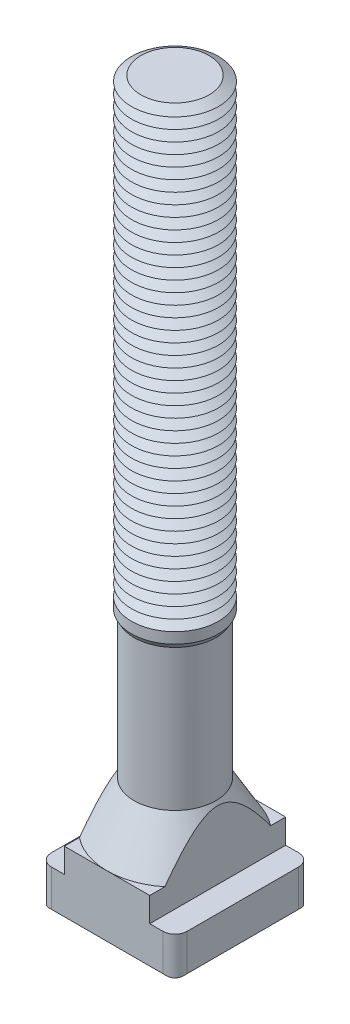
ISO-10303-21;
HEADER;
FILE_DESCRIPTION(('STEP AP214'),'2;1');
FILE_NAME('part.step','',(''),(''),'','','');
FILE_SCHEMA(('AUTOMOTIVE_DESIGN { 1 0 10303 214 1 1 1 1 }'));
ENDSEC;
DATA;
#1=APPLICATION_CONTEXT('core data for automotive mechanical design processes');
#2=APPLICATION_PROTOCOL_DEFINITION('international standard','automotive_design',2000,#1);
#3=PRODUCT_CONTEXT('',#1,'mechanical');
#4=PRODUCT('Part','Part','',(#3));
#5=PRODUCT_RELATED_PRODUCT_CATEGORY('part','',(#4));
#6=PRODUCT_DEFINITION_FORMATION('','',#4);
#7=PRODUCT_DEFINITION_CONTEXT('part definition',#1,'design');
#8=PRODUCT_DEFINITION('design','',#6,#7);
#9=PRODUCT_DEFINITION_SHAPE('','',#8);
#10=(LENGTH_UNIT() NAMED_UNIT(*) SI_UNIT(.MILLI.,.METRE.));
#11=(NAMED_UNIT(*) PLANE_ANGLE_UNIT() SI_UNIT($,.RADIAN.));
#12=(NAMED_UNIT(*) SI_UNIT($,.STERADIAN.) SOLID_ANGLE_UNIT());
#13=UNCERTAINTY_MEASURE_WITH_UNIT(LENGTH_MEASURE(1.E-05),#10,'distance_accuracy_value','');
#14=(GEOMETRIC_REPRESENTATION_CONTEXT(3) GLOBAL_UNCERTAINTY_ASSIGNED_CONTEXT((#13)) GLOBAL_UNIT_ASSIGNED_CONTEXT((#10,
#11,#12)) REPRESENTATION_CONTEXT('',''));
#15=CARTESIAN_POINT('',(0.,0.,0.));
#16=DIRECTION('',(0.,0.,1.));
#17=DIRECTION('',(1.,0.,0.));
#18=AXIS2_PLACEMENT_3D('',#15,#16,#17);
#19=CARTESIAN_POINT('',(0.,126.,0.));
#20=DIRECTION('',(0.,-1.,0.));
#21=DIRECTION('',(0.,0.,-1.));
#22=AXIS2_PLACEMENT_3D('',#19,#20,#21);
#23=CONICAL_SURFACE('',#22,6.26794919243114,1.0471975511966);
#24=CARTESIAN_POINT('',(0.,125.,0.));
#25=DIRECTION('',(0.,-1.,0.));
#26=DIRECTION('',(0.,0.,-1.));
#27=AXIS2_PLACEMENT_3D('',#24,#25,#26);
#28=CIRCLE('',#27,8.00000000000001);
#29=CARTESIAN_POINT('',(0.,125.,-8.00000000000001));
#30=VERTEX_POINT('',#29);
#31=EDGE_CURVE('E725',#30,#30,#28,.T.);
#32=ORIENTED_EDGE('',*,*,#31,.F.);
#33=EDGE_LOOP('',(#32));
#34=FACE_BOUND('',#33,.T.);
#35=CARTESIAN_POINT('',(0.,126.,0.));
#36=DIRECTION('',(0.,-1.,0.));
#37=DIRECTION('',(0.,0.,-1.));
#38=AXIS2_PLACEMENT_3D('',#35,#36,#37);
#39=CIRCLE('',#38,6.26794919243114);
#40=CARTESIAN_POINT('',(0.,126.,-6.26794919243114));
#41=VERTEX_POINT('',#40);
#42=EDGE_CURVE('E722',#41,#41,#39,.T.);
#43=ORIENTED_EDGE('',*,*,#42,.T.);
#44=EDGE_LOOP('',(#43));
#45=FACE_BOUND('',#44,.T.);
#46=ADVANCED_FACE('F39',(#34,#45),#23,.T.);
#47=CARTESIAN_POINT('',(0.,127.,0.));
#48=DIRECTION('',(0.,1.,0.));
#49=DIRECTION('',(0.,0.,1.));
#50=AXIS2_PLACEMENT_3D('',#47,#48,#49);
#51=CONICAL_SURFACE('',#50,8.00000000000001,1.0471975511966);
#52=ORIENTED_EDGE('',*,*,#42,.F.);
#53=EDGE_LOOP('',(#52));
#54=FACE_BOUND('',#53,.T.);
#55=CARTESIAN_POINT('',(0.,127.,0.));
#56=DIRECTION('',(0.,-1.,0.));
#57=DIRECTION('',(0.,0.,-1.));
#58=AXIS2_PLACEMENT_3D('',#55,#56,#57);
#59=CIRCLE('',#58,8.00000000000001);
#60=CARTESIAN_POINT('',(0.,127.,-8.00000000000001));
#61=VERTEX_POINT('',#60);
#62=EDGE_CURVE('E718',#61,#61,#59,.T.);
#63=ORIENTED_EDGE('',*,*,#62,.T.);
#64=EDGE_LOOP('',(#63));
#65=FACE_BOUND('',#64,.T.);
#66=ADVANCED_FACE('F448',(#54,#65),#51,.T.);
#67=CARTESIAN_POINT('',(3.97663295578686,134.,0.));
#68=DIRECTION('',(0.,-1.,0.));
#69=DIRECTION('',(1.,0.,0.));
#70=AXIS2_PLACEMENT_3D('',#67,#68,#69);
#71=PLANE('',#70);
#72=CARTESIAN_POINT('',(0.,134.,0.));
#73=DIRECTION('',(0.,-1.,0.));
#74=DIRECTION('',(0.,0.,-1.));
#75=AXIS2_PLACEMENT_3D('',#72,#73,#74);
#76=CIRCLE('',#75,6.26794919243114);
#77=CARTESIAN_POINT('',(0.,134.,-6.26794919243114));
#78=VERTEX_POINT('',#77);
#79=EDGE_CURVE('E790',#78,#78,#76,.T.);
#80=ORIENTED_EDGE('',*,*,#79,.F.);
#81=EDGE_LOOP('',(#80));
#82=FACE_BOUND('',#81,.T.);
#83=ADVANCED_FACE('F454',(#82),#71,.F.);
#84=CARTESIAN_POINT('',(0.,134.,0.));
#85=DIRECTION('',(0.,-1.,0.));
#86=DIRECTION('',(0.,0.,-1.));
#87=AXIS2_PLACEMENT_3D('',#84,#85,#86);
#88=CONICAL_SURFACE('',#87,6.26794919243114,1.0471975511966);
#89=CARTESIAN_POINT('',(0.,133.,0.));
#90=DIRECTION('',(0.,-1.,0.));
#91=DIRECTION('',(0.,0.,-1.));
#92=AXIS2_PLACEMENT_3D('',#89,#90,#91);
#93=CIRCLE('',#92,8.00000000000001);
#94=CARTESIAN_POINT('',(0.,133.,-8.00000000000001));
#95=VERTEX_POINT('',#94);
#96=EDGE_CURVE('E642',#95,#95,#93,.T.);
#97=ORIENTED_EDGE('',*,*,#96,.F.);
#98=EDGE_LOOP('',(#97));
#99=FACE_BOUND('',#98,.T.);
#100=ORIENTED_EDGE('',*,*,#79,.T.);
#101=EDGE_LOOP('',(#100));
#102=FACE_BOUND('',#101,.T.);
#103=ADVANCED_FACE('F482',(#99,#102),#88,.T.);
#104=CARTESIAN_POINT('',(0.,133.,0.));
#105=DIRECTION('',(0.,1.,0.));
#106=DIRECTION('',(0.,0.,1.));
#107=AXIS2_PLACEMENT_3D('',#104,#105,#106);
#108=CONICAL_SURFACE('',#107,8.00000000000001,1.0471975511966);
#109=CARTESIAN_POINT('',(0.,132.,0.));
#110=DIRECTION('',(0.,-1.,0.));
#111=DIRECTION('',(0.,0.,-1.));
#112=AXIS2_PLACEMENT_3D('',#109,#110,#111);
#113=CIRCLE('',#112,6.26794919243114);
#114=CARTESIAN_POINT('',(0.,132.,-6.26794919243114));
#115=VERTEX_POINT('',#114);
#116=EDGE_CURVE('E639',#115,#115,#113,.T.);
#117=ORIENTED_EDGE('',*,*,#116,.F.);
#118=EDGE_LOOP('',(#117));
#119=FACE_BOUND('',#118,.T.);
#120=ORIENTED_EDGE('',*,*,#96,.T.);
#121=EDGE_LOOP('',(#120));
#122=FACE_BOUND('',#121,.T.);
#123=ADVANCED_FACE('F479',(#119,#122),#108,.T.);
#124=CARTESIAN_POINT('',(0.,132.,0.));
#125=DIRECTION('',(0.,-1.,0.));
#126=DIRECTION('',(0.,0.,-1.));
#127=AXIS2_PLACEMENT_3D('',#124,#125,#126);
#128=CONICAL_SURFACE('',#127,6.26794919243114,1.0471975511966);
#129=CARTESIAN_POINT('',(0.,131.,0.));
#130=DIRECTION('',(0.,-1.,0.));
#131=DIRECTION('',(0.,0.,-1.));
#132=AXIS2_PLACEMENT_3D('',#129,#130,#131);
#133=CIRCLE('',#132,8.00000000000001);
#134=CARTESIAN_POINT('',(0.,131.,-8.00000000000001));
#135=VERTEX_POINT('',#134);
#136=EDGE_CURVE('E643',#135,#135,#133,.T.);
#137=ORIENTED_EDGE('',*,*,#136,.F.);
#138=EDGE_LOOP('',(#137));
#139=FACE_BOUND('',#138,.T.);
#140=ORIENTED_EDGE('',*,*,#116,.T.);
#141=EDGE_LOOP('',(#140));
#142=FACE_BOUND('',#141,.T.);
#143=ADVANCED_FACE('F474',(#139,#142),#128,.T.);
#144=CARTESIAN_POINT('',(0.,131.,0.));
#145=DIRECTION('',(0.,1.,0.));
#146=DIRECTION('',(0.,0.,1.));
#147=AXIS2_PLACEMENT_3D('',#144,#145,#146);
#148=CONICAL_SURFACE('',#147,8.00000000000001,1.0471975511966);
#149=CARTESIAN_POINT('',(0.,130.,0.));
#150=DIRECTION('',(0.,-1.,0.));
#151=DIRECTION('',(0.,0.,-1.));
#152=AXIS2_PLACEMENT_3D('',#149,#150,#151);
#153=CIRCLE('',#152,6.26794919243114);
#154=CARTESIAN_POINT('',(0.,130.,-6.26794919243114));
#155=VERTEX_POINT('',#154);
#156=EDGE_CURVE('E780',#155,#155,#153,.T.);
#157=ORIENTED_EDGE('',*,*,#156,.F.);
#158=EDGE_LOOP('',(#157));
#159=FACE_BOUND('',#158,.T.);
#160=ORIENTED_EDGE('',*,*,#136,.T.);
#161=EDGE_LOOP('',(#160));
#162=FACE_BOUND('',#161,.T.);
#163=ADVANCED_FACE('F471',(#159,#162),#148,.T.);
#164=CARTESIAN_POINT('',(0.,130.,0.));
#165=DIRECTION('',(0.,-1.,0.));
#166=DIRECTION('',(0.,0.,-1.));
#167=AXIS2_PLACEMENT_3D('',#164,#165,#166);
#168=CONICAL_SURFACE('',#167,6.26794919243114,1.0471975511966);
#169=CARTESIAN_POINT('',(0.,129.,0.));
#170=DIRECTION('',(0.,-1.,0.));
#171=DIRECTION('',(0.,0.,-1.));
#172=AXIS2_PLACEMENT_3D('',#169,#170,#171);
#173=CIRCLE('',#172,8.00000000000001);
#174=CARTESIAN_POINT('',(0.,129.,-8.00000000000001));
#175=VERTEX_POINT('',#174);
#176=EDGE_CURVE('E776',#175,#175,#173,.T.);
#177=ORIENTED_EDGE('',*,*,#176,.F.);
#178=EDGE_LOOP('',(#177));
#179=FACE_BOUND('',#178,.T.);
#180=ORIENTED_EDGE('',*,*,#156,.T.);
#181=EDGE_LOOP('',(#180));
#182=FACE_BOUND('',#181,.T.);
#183=ADVANCED_FACE('F465',(#179,#182),#168,.T.);
#184=CARTESIAN_POINT('',(0.,129.,0.));
#185=DIRECTION('',(0.,1.,0.));
#186=DIRECTION('',(0.,0.,1.));
#187=AXIS2_PLACEMENT_3D('',#184,#185,#186);
#188=CONICAL_SURFACE('',#187,8.00000000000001,1.0471975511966);
#189=CARTESIAN_POINT('',(0.,128.,0.));
#190=DIRECTION('',(0.,-1.,0.));
#191=DIRECTION('',(0.,0.,-1.));
#192=AXIS2_PLACEMENT_3D('',#189,#190,#191);
#193=CIRCLE('',#192,6.26794919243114);
#194=CARTESIAN_POINT('',(0.,128.,-6.26794919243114));
#195=VERTEX_POINT('',#194);
#196=EDGE_CURVE('E721',#195,#195,#193,.T.);
#197=ORIENTED_EDGE('',*,*,#196,.F.);
#198=EDGE_LOOP('',(#197));
#199=FACE_BOUND('',#198,.T.);
#200=ORIENTED_EDGE('',*,*,#176,.T.);
#201=EDGE_LOOP('',(#200));
#202=FACE_BOUND('',#201,.T.);
#203=ADVANCED_FACE('F461',(#199,#202),#188,.T.);
#204=CARTESIAN_POINT('',(0.,128.,0.));
#205=DIRECTION('',(0.,-1.,0.));
#206=DIRECTION('',(0.,0.,-1.));
#207=AXIS2_PLACEMENT_3D('',#204,#205,#206);
#208=CONICAL_SURFACE('',#207,6.26794919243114,1.0471975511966);
#209=ORIENTED_EDGE('',*,*,#62,.F.);
#210=EDGE_LOOP('',(#209));
#211=FACE_BOUND('',#210,.T.);
#212=ORIENTED_EDGE('',*,*,#196,.T.);
#213=EDGE_LOOP('',(#212));
#214=FACE_BOUND('',#213,.T.);
#215=ADVANCED_FACE('F464',(#211,#214),#208,.T.);
#216=CARTESIAN_POINT('',(0.,124.,0.));
#217=DIRECTION('',(0.,-1.,0.));
#218=DIRECTION('',(0.,0.,-1.));
#219=AXIS2_PLACEMENT_3D('',#216,#217,#218);
#220=CONICAL_SURFACE('',#219,6.26794919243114,1.0471975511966);
#221=CARTESIAN_POINT('',(0.,123.,0.));
#222=DIRECTION('',(0.,-1.,0.));
#223=DIRECTION('',(0.,0.,-1.));
#224=AXIS2_PLACEMENT_3D('',#221,#222,#223);
#225=CIRCLE('',#224,8.00000000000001);
#226=CARTESIAN_POINT('',(0.,123.,-8.00000000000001));
#227=VERTEX_POINT('',#226);
#228=EDGE_CURVE('E755',#227,#227,#225,.T.);
#229=ORIENTED_EDGE('',*,*,#228,.F.);
#230=EDGE_LOOP('',(#229));
#231=FACE_BOUND('',#230,.T.);
#232=CARTESIAN_POINT('',(0.,124.,0.));
#233=DIRECTION('',(0.,-1.,0.));
#234=DIRECTION('',(0.,0.,-1.));
#235=AXIS2_PLACEMENT_3D('',#232,#233,#234);
#236=CIRCLE('',#235,6.26794919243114);
#237=CARTESIAN_POINT('',(0.,124.,-6.26794919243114));
#238=VERTEX_POINT('',#237);
#239=EDGE_CURVE('E766',#238,#238,#236,.T.);
#240=ORIENTED_EDGE('',*,*,#239,.T.);
#241=EDGE_LOOP('',(#240));
#242=FACE_BOUND('',#241,.T.);
#243=ADVANCED_FACE('F469',(#231,#242),#220,.T.);
#244=CARTESIAN_POINT('',(0.,125.,0.));
#245=DIRECTION('',(0.,1.,0.));
#246=DIRECTION('',(0.,0.,1.));
#247=AXIS2_PLACEMENT_3D('',#244,#245,#246);
#248=CONICAL_SURFACE('',#247,8.00000000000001,1.0471975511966);
#249=ORIENTED_EDGE('',*,*,#239,.F.);
#250=EDGE_LOOP('',(#249));
#251=FACE_BOUND('',#250,.T.);
#252=ORIENTED_EDGE('',*,*,#31,.T.);
#253=EDGE_LOOP('',(#252));
#254=FACE_BOUND('',#253,.T.);
#255=ADVANCED_FACE('F1662',(#251,#254),#248,.T.);
#256=CARTESIAN_POINT('',(0.,122.,0.));
#257=DIRECTION('',(0.,-1.,0.));
#258=DIRECTION('',(0.,0.,-1.));
#259=AXIS2_PLACEMENT_3D('',#256,#257,#258);
#260=CONICAL_SURFACE('',#259,6.26794919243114,1.0471975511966);
#261=CARTESIAN_POINT('',(0.,121.,0.));
#262=DIRECTION('',(0.,-1.,0.));
#263=DIRECTION('',(0.,0.,-1.));
#264=AXIS2_PLACEMENT_3D('',#261,#262,#263);
#265=CIRCLE('',#264,8.00000000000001);
#266=CARTESIAN_POINT('',(0.,121.,-8.00000000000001));
#267=VERTEX_POINT('',#266);
#268=EDGE_CURVE('E746',#267,#267,#265,.T.);
#269=ORIENTED_EDGE('',*,*,#268,.F.);
#270=EDGE_LOOP('',(#269));
#271=FACE_BOUND('',#270,.T.);
#272=CARTESIAN_POINT('',(0.,122.,0.));
#273=DIRECTION('',(0.,-1.,0.));
#274=DIRECTION('',(0.,0.,-1.));
#275=AXIS2_PLACEMENT_3D('',#272,#273,#274);
#276=CIRCLE('',#275,6.26794919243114);
#277=CARTESIAN_POINT('',(0.,122.,-6.26794919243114));
#278=VERTEX_POINT('',#277);
#279=EDGE_CURVE('E748',#278,#278,#276,.T.);
#280=ORIENTED_EDGE('',*,*,#279,.T.);
#281=EDGE_LOOP('',(#280));
#282=FACE_BOUND('',#281,.T.);
#283=ADVANCED_FACE('F1652',(#271,#282),#260,.T.);
#284=CARTESIAN_POINT('',(0.,123.,0.));
#285=DIRECTION('',(0.,1.,0.));
#286=DIRECTION('',(0.,0.,1.));
#287=AXIS2_PLACEMENT_3D('',#284,#285,#286);
#288=CONICAL_SURFACE('',#287,8.00000000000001,1.0471975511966);
#289=ORIENTED_EDGE('',*,*,#279,.F.);
#290=EDGE_LOOP('',(#289));
#291=FACE_BOUND('',#290,.T.);
#292=ORIENTED_EDGE('',*,*,#228,.T.);
#293=EDGE_LOOP('',(#292));
#294=FACE_BOUND('',#293,.T.);
#295=ADVANCED_FACE('F1642',(#291,#294),#288,.T.);
#296=CARTESIAN_POINT('',(0.,120.,0.));
#297=DIRECTION('',(0.,-1.,0.));
#298=DIRECTION('',(0.,0.,-1.));
#299=AXIS2_PLACEMENT_3D('',#296,#297,#298);
#300=CONICAL_SURFACE('',#299,6.26794919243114,1.0471975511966);
#301=CARTESIAN_POINT('',(0.,119.,0.));
#302=DIRECTION('',(0.,-1.,0.));
#303=DIRECTION('',(0.,0.,-1.));
#304=AXIS2_PLACEMENT_3D('',#301,#302,#303);
#305=CIRCLE('',#304,8.00000000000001);
#306=CARTESIAN_POINT('',(0.,119.,-8.00000000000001));
#307=VERTEX_POINT('',#306);
#308=EDGE_CURVE('E759',#307,#307,#305,.T.);
#309=ORIENTED_EDGE('',*,*,#308,.F.);
#310=EDGE_LOOP('',(#309));
#311=FACE_BOUND('',#310,.T.);
#312=CARTESIAN_POINT('',(0.,120.,0.));
#313=DIRECTION('',(0.,-1.,0.));
#314=DIRECTION('',(0.,0.,-1.));
#315=AXIS2_PLACEMENT_3D('',#312,#313,#314);
#316=CIRCLE('',#315,6.26794919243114);
#317=CARTESIAN_POINT('',(0.,120.,-6.26794919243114));
#318=VERTEX_POINT('',#317);
#319=EDGE_CURVE('E749',#318,#318,#316,.T.);
#320=ORIENTED_EDGE('',*,*,#319,.T.);
#321=EDGE_LOOP('',(#320));
#322=FACE_BOUND('',#321,.T.);
#323=ADVANCED_FACE('F1632',(#311,#322),#300,.T.);
#324=CARTESIAN_POINT('',(0.,121.,0.));
#325=DIRECTION('',(0.,1.,0.));
#326=DIRECTION('',(0.,0.,1.));
#327=AXIS2_PLACEMENT_3D('',#324,#325,#326);
#328=CONICAL_SURFACE('',#327,8.00000000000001,1.0471975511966);
#329=ORIENTED_EDGE('',*,*,#319,.F.);
#330=EDGE_LOOP('',(#329));
#331=FACE_BOUND('',#330,.T.);
#332=ORIENTED_EDGE('',*,*,#268,.T.);
#333=EDGE_LOOP('',(#332));
#334=FACE_BOUND('',#333,.T.);
#335=ADVANCED_FACE('F1622',(#331,#334),#328,.T.);
#336=CARTESIAN_POINT('',(0.,118.,0.));
#337=DIRECTION('',(0.,-1.,0.));
#338=DIRECTION('',(0.,0.,-1.));
#339=AXIS2_PLACEMENT_3D('',#336,#337,#338);
#340=CONICAL_SURFACE('',#339,6.26794919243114,1.0471975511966);
#341=CARTESIAN_POINT('',(0.,117.,0.));
#342=DIRECTION('',(0.,-1.,0.));
#343=DIRECTION('',(0.,0.,-1.));
#344=AXIS2_PLACEMENT_3D('',#341,#342,#343);
#345=CIRCLE('',#344,8.00000000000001);
#346=CARTESIAN_POINT('',(0.,117.,-8.00000000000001));
#347=VERTEX_POINT('',#346);
#348=EDGE_CURVE('E885',#347,#347,#345,.T.);
#349=ORIENTED_EDGE('',*,*,#348,.F.);
#350=EDGE_LOOP('',(#349));
#351=FACE_BOUND('',#350,.T.);
#352=CARTESIAN_POINT('',(0.,118.,0.));
#353=DIRECTION('',(0.,-1.,0.));
#354=DIRECTION('',(0.,0.,-1.));
#355=AXIS2_PLACEMENT_3D('',#352,#353,#354);
#356=CIRCLE('',#355,6.26794919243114);
#357=CARTESIAN_POINT('',(0.,118.,-6.26794919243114));
#358=VERTEX_POINT('',#357);
#359=EDGE_CURVE('E908',#358,#358,#356,.T.);
#360=ORIENTED_EDGE('',*,*,#359,.T.);
#361=EDGE_LOOP('',(#360));
#362=FACE_BOUND('',#361,.T.);
#363=ADVANCED_FACE('F1612',(#351,#362),#340,.T.);
#364=CARTESIAN_POINT('',(0.,119.,0.));
#365=DIRECTION('',(0.,1.,0.));
#366=DIRECTION('',(0.,0.,1.));
#367=AXIS2_PLACEMENT_3D('',#364,#365,#366);
#368=CONICAL_SURFACE('',#367,8.00000000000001,1.0471975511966);
#369=ORIENTED_EDGE('',*,*,#359,.F.);
#370=EDGE_LOOP('',(#369));
#371=FACE_BOUND('',#370,.T.);
#372=ORIENTED_EDGE('',*,*,#308,.T.);
#373=EDGE_LOOP('',(#372));
#374=FACE_BOUND('',#373,.T.);
#375=ADVANCED_FACE('F1602',(#371,#374),#368,.T.);
#376=CARTESIAN_POINT('',(0.,116.,0.));
#377=DIRECTION('',(0.,-1.,0.));
#378=DIRECTION('',(0.,0.,-1.));
#379=AXIS2_PLACEMENT_3D('',#376,#377,#378);
#380=CONICAL_SURFACE('',#379,6.26794919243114,1.0471975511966);
#381=CARTESIAN_POINT('',(0.,115.,0.));
#382=DIRECTION('',(0.,-1.,0.));
#383=DIRECTION('',(0.,0.,-1.));
#384=AXIS2_PLACEMENT_3D('',#381,#382,#383);
#385=CIRCLE('',#384,8.00000000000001);
#386=CARTESIAN_POINT('',(0.,115.,-8.00000000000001));
#387=VERTEX_POINT('',#386);
#388=EDGE_CURVE('E843',#387,#387,#385,.T.);
#389=ORIENTED_EDGE('',*,*,#388,.F.);
#390=EDGE_LOOP('',(#389));
#391=FACE_BOUND('',#390,.T.);
#392=CARTESIAN_POINT('',(0.,116.,0.));
#393=DIRECTION('',(0.,-1.,0.));
#394=DIRECTION('',(0.,0.,-1.));
#395=AXIS2_PLACEMENT_3D('',#392,#393,#394);
#396=CIRCLE('',#395,6.26794919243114);
#397=CARTESIAN_POINT('',(0.,116.,-6.26794919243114));
#398=VERTEX_POINT('',#397);
#399=EDGE_CURVE('E883',#398,#398,#396,.T.);
#400=ORIENTED_EDGE('',*,*,#399,.T.);
#401=EDGE_LOOP('',(#400));
#402=FACE_BOUND('',#401,.T.);
#403=ADVANCED_FACE('F1592',(#391,#402),#380,.T.);
#404=CARTESIAN_POINT('',(0.,117.,0.));
#405=DIRECTION('',(0.,1.,0.));
#406=DIRECTION('',(0.,0.,1.));
#407=AXIS2_PLACEMENT_3D('',#404,#405,#406);
#408=CONICAL_SURFACE('',#407,8.00000000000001,1.0471975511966);
#409=ORIENTED_EDGE('',*,*,#399,.F.);
#410=EDGE_LOOP('',(#409));
#411=FACE_BOUND('',#410,.T.);
#412=ORIENTED_EDGE('',*,*,#348,.T.);
#413=EDGE_LOOP('',(#412));
#414=FACE_BOUND('',#413,.T.);
#415=ADVANCED_FACE('F1582',(#411,#414),#408,.T.);
#416=CARTESIAN_POINT('',(0.,114.,0.));
#417=DIRECTION('',(0.,-1.,0.));
#418=DIRECTION('',(0.,0.,-1.));
#419=AXIS2_PLACEMENT_3D('',#416,#417,#418);
#420=CONICAL_SURFACE('',#419,6.26794919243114,1.0471975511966);
#421=CARTESIAN_POINT('',(0.,113.,0.));
#422=DIRECTION('',(0.,-1.,0.));
#423=DIRECTION('',(0.,0.,-1.));
#424=AXIS2_PLACEMENT_3D('',#421,#422,#423);
#425=CIRCLE('',#424,8.00000000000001);
#426=CARTESIAN_POINT('',(0.,113.,-8.00000000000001));
#427=VERTEX_POINT('',#426);
#428=EDGE_CURVE('E844',#427,#427,#425,.T.);
#429=ORIENTED_EDGE('',*,*,#428,.F.);
#430=EDGE_LOOP('',(#429));
#431=FACE_BOUND('',#430,.T.);
#432=CARTESIAN_POINT('',(0.,114.,0.));
#433=DIRECTION('',(0.,-1.,0.));
#434=DIRECTION('',(0.,0.,-1.));
#435=AXIS2_PLACEMENT_3D('',#432,#433,#434);
#436=CIRCLE('',#435,6.26794919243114);
#437=CARTESIAN_POINT('',(0.,114.,-6.26794919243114));
#438=VERTEX_POINT('',#437);
#439=EDGE_CURVE('E841',#438,#438,#436,.T.);
#440=ORIENTED_EDGE('',*,*,#439,.T.);
#441=EDGE_LOOP('',(#440));
#442=FACE_BOUND('',#441,.T.);
#443=ADVANCED_FACE('F1572',(#431,#442),#420,.T.);
#444=CARTESIAN_POINT('',(0.,115.,0.));
#445=DIRECTION('',(0.,1.,0.));
#446=DIRECTION('',(0.,0.,1.));
#447=AXIS2_PLACEMENT_3D('',#444,#445,#446);
#448=CONICAL_SURFACE('',#447,8.00000000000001,1.0471975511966);
#449=ORIENTED_EDGE('',*,*,#439,.F.);
#450=EDGE_LOOP('',(#449));
#451=FACE_BOUND('',#450,.T.);
#452=ORIENTED_EDGE('',*,*,#388,.T.);
#453=EDGE_LOOP('',(#452));
#454=FACE_BOUND('',#453,.T.);
#455=ADVANCED_FACE('F1562',(#451,#454),#448,.T.);
#456=CARTESIAN_POINT('',(0.,112.,0.));
#457=DIRECTION('',(0.,-1.,0.));
#458=DIRECTION('',(0.,0.,-1.));
#459=AXIS2_PLACEMENT_3D('',#456,#457,#458);
#460=CONICAL_SURFACE('',#459,6.26794919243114,1.0471975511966);
#461=CARTESIAN_POINT('',(0.,111.,0.));
#462=DIRECTION('',(0.,-1.,0.));
#463=DIRECTION('',(0.,0.,-1.));
#464=AXIS2_PLACEMENT_3D('',#461,#462,#463);
#465=CIRCLE('',#464,8.00000000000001);
#466=CARTESIAN_POINT('',(0.,111.,-8.00000000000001));
#467=VERTEX_POINT('',#466);
#468=EDGE_CURVE('E815',#467,#467,#465,.T.);
#469=ORIENTED_EDGE('',*,*,#468,.F.);
#470=EDGE_LOOP('',(#469));
#471=FACE_BOUND('',#470,.T.);
#472=CARTESIAN_POINT('',(0.,112.,0.));
#473=DIRECTION('',(0.,-1.,0.));
#474=DIRECTION('',(0.,0.,-1.));
#475=AXIS2_PLACEMENT_3D('',#472,#473,#474);
#476=CIRCLE('',#475,6.26794919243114);
#477=CARTESIAN_POINT('',(0.,112.,-6.26794919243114));
#478=VERTEX_POINT('',#477);
#479=EDGE_CURVE('E817',#478,#478,#476,.T.);
#480=ORIENTED_EDGE('',*,*,#479,.T.);
#481=EDGE_LOOP('',(#480));
#482=FACE_BOUND('',#481,.T.);
#483=ADVANCED_FACE('F1552',(#471,#482),#460,.T.);
#484=CARTESIAN_POINT('',(0.,113.,0.));
#485=DIRECTION('',(0.,1.,0.));
#486=DIRECTION('',(0.,0.,1.));
#487=AXIS2_PLACEMENT_3D('',#484,#485,#486);
#488=CONICAL_SURFACE('',#487,8.00000000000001,1.0471975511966);
#489=ORIENTED_EDGE('',*,*,#479,.F.);
#490=EDGE_LOOP('',(#489));
#491=FACE_BOUND('',#490,.T.);
#492=ORIENTED_EDGE('',*,*,#428,.T.);
#493=EDGE_LOOP('',(#492));
#494=FACE_BOUND('',#493,.T.);
#495=ADVANCED_FACE('F1542',(#491,#494),#488,.T.);
#496=CARTESIAN_POINT('',(0.,110.,0.));
#497=DIRECTION('',(0.,-1.,0.));
#498=DIRECTION('',(0.,0.,-1.));
#499=AXIS2_PLACEMENT_3D('',#496,#497,#498);
#500=CONICAL_SURFACE('',#499,6.26794919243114,1.0471975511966);
#501=CARTESIAN_POINT('',(0.,109.,0.));
#502=DIRECTION('',(0.,-1.,0.));
#503=DIRECTION('',(0.,0.,-1.));
#504=AXIS2_PLACEMENT_3D('',#501,#502,#503);
#505=CIRCLE('',#504,8.00000000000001);
#506=CARTESIAN_POINT('',(0.,109.,-8.00000000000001));
#507=VERTEX_POINT('',#506);
#508=EDGE_CURVE('E636',#507,#507,#505,.T.);
#509=ORIENTED_EDGE('',*,*,#508,.F.);
#510=EDGE_LOOP('',(#509));
#511=FACE_BOUND('',#510,.T.);
#512=CARTESIAN_POINT('',(0.,110.,0.));
#513=DIRECTION('',(0.,-1.,0.));
#514=DIRECTION('',(0.,0.,-1.));
#515=AXIS2_PLACEMENT_3D('',#512,#513,#514);
#516=CIRCLE('',#515,6.26794919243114);
#517=CARTESIAN_POINT('',(0.,110.,-6.26794919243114));
#518=VERTEX_POINT('',#517);
#519=EDGE_CURVE('E818',#518,#518,#516,.T.);
#520=ORIENTED_EDGE('',*,*,#519,.T.);
#521=EDGE_LOOP('',(#520));
#522=FACE_BOUND('',#521,.T.);
#523=ADVANCED_FACE('F1532',(#511,#522),#500,.T.);
#524=CARTESIAN_POINT('',(0.,111.,0.));
#525=DIRECTION('',(0.,1.,0.));
#526=DIRECTION('',(0.,0.,1.));
#527=AXIS2_PLACEMENT_3D('',#524,#525,#526);
#528=CONICAL_SURFACE('',#527,8.00000000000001,1.0471975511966);
#529=ORIENTED_EDGE('',*,*,#519,.F.);
#530=EDGE_LOOP('',(#529));
#531=FACE_BOUND('',#530,.T.);
#532=ORIENTED_EDGE('',*,*,#468,.T.);
#533=EDGE_LOOP('',(#532));
#534=FACE_BOUND('',#533,.T.);
#535=ADVANCED_FACE('F1522',(#531,#534),#528,.T.);
#536=CARTESIAN_POINT('',(0.,108.,0.));
#537=DIRECTION('',(0.,-1.,0.));
#538=DIRECTION('',(0.,0.,-1.));
#539=AXIS2_PLACEMENT_3D('',#536,#537,#538);
#540=CONICAL_SURFACE('',#539,6.26794919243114,1.0471975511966);
#541=CARTESIAN_POINT('',(0.,107.,0.));
#542=DIRECTION('',(0.,-1.,0.));
#543=DIRECTION('',(0.,0.,-1.));
#544=AXIS2_PLACEMENT_3D('',#541,#542,#543);
#545=CIRCLE('',#544,8.00000000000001);
#546=CARTESIAN_POINT('',(0.,107.,-8.00000000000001));
#547=VERTEX_POINT('',#546);
#548=EDGE_CURVE('E637',#547,#547,#545,.T.);
#549=ORIENTED_EDGE('',*,*,#548,.F.);
#550=EDGE_LOOP('',(#549));
#551=FACE_BOUND('',#550,.T.);
#552=CARTESIAN_POINT('',(0.,108.,0.));
#553=DIRECTION('',(0.,-1.,0.));
#554=DIRECTION('',(0.,0.,-1.));
#555=AXIS2_PLACEMENT_3D('',#552,#553,#554);
#556=CIRCLE('',#555,6.26794919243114);
#557=CARTESIAN_POINT('',(0.,108.,-6.26794919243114));
#558=VERTEX_POINT('',#557);
#559=EDGE_CURVE('E633',#558,#558,#556,.T.);
#560=ORIENTED_EDGE('',*,*,#559,.T.);
#561=EDGE_LOOP('',(#560));
#562=FACE_BOUND('',#561,.T.);
#563=ADVANCED_FACE('F1512',(#551,#562),#540,.T.);
#564=CARTESIAN_POINT('',(0.,109.,0.));
#565=DIRECTION('',(0.,1.,0.));
#566=DIRECTION('',(0.,0.,1.));
#567=AXIS2_PLACEMENT_3D('',#564,#565,#566);
#568=CONICAL_SURFACE('',#567,8.00000000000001,1.0471975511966);
#569=ORIENTED_EDGE('',*,*,#559,.F.);
#570=EDGE_LOOP('',(#569));
#571=FACE_BOUND('',#570,.T.);
#572=ORIENTED_EDGE('',*,*,#508,.T.);
#573=EDGE_LOOP('',(#572));
#574=FACE_BOUND('',#573,.T.);
#575=ADVANCED_FACE('F1502',(#571,#574),#568,.T.);
#576=CARTESIAN_POINT('',(0.,106.,0.));
#577=DIRECTION('',(0.,-1.,0.));
#578=DIRECTION('',(0.,0.,-1.));
#579=AXIS2_PLACEMENT_3D('',#576,#577,#578);
#580=CONICAL_SURFACE('',#579,6.26794919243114,1.0471975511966);
#581=CARTESIAN_POINT('',(0.,105.,0.));
#582=DIRECTION('',(0.,-1.,0.));
#583=DIRECTION('',(0.,0.,-1.));
#584=AXIS2_PLACEMENT_3D('',#581,#582,#583);
#585=CIRCLE('',#584,8.00000000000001);
#586=CARTESIAN_POINT('',(0.,105.,-8.00000000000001));
#587=VERTEX_POINT('',#586);
#588=EDGE_CURVE('E878',#587,#587,#585,.T.);
#589=ORIENTED_EDGE('',*,*,#588,.F.);
#590=EDGE_LOOP('',(#589));
#591=FACE_BOUND('',#590,.T.);
#592=CARTESIAN_POINT('',(0.,106.,0.));
#593=DIRECTION('',(0.,-1.,0.));
#594=DIRECTION('',(0.,0.,-1.));
#595=AXIS2_PLACEMENT_3D('',#592,#593,#594);
#596=CIRCLE('',#595,6.26794919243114);
#597=CARTESIAN_POINT('',(0.,106.,-6.26794919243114));
#598=VERTEX_POINT('',#597);
#599=EDGE_CURVE('E875',#598,#598,#596,.T.);
#600=ORIENTED_EDGE('',*,*,#599,.T.);
#601=EDGE_LOOP('',(#600));
#602=FACE_BOUND('',#601,.T.);
#603=ADVANCED_FACE('F1492',(#591,#602),#580,.T.);
#604=CARTESIAN_POINT('',(0.,107.,0.));
#605=DIRECTION('',(0.,1.,0.));
#606=DIRECTION('',(0.,0.,1.));
#607=AXIS2_PLACEMENT_3D('',#604,#605,#606);
#608=CONICAL_SURFACE('',#607,8.00000000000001,1.0471975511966);
#609=ORIENTED_EDGE('',*,*,#599,.F.);
#610=EDGE_LOOP('',(#609));
#611=FACE_BOUND('',#610,.T.);
#612=ORIENTED_EDGE('',*,*,#548,.T.);
#613=EDGE_LOOP('',(#612));
#614=FACE_BOUND('',#613,.T.);
#615=ADVANCED_FACE('F1482',(#611,#614),#608,.T.);
#616=CARTESIAN_POINT('',(0.,104.,0.));
#617=DIRECTION('',(0.,-1.,0.));
#618=DIRECTION('',(0.,0.,-1.));
#619=AXIS2_PLACEMENT_3D('',#616,#617,#618);
#620=CONICAL_SURFACE('',#619,6.26794919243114,1.0471975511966);
#621=CARTESIAN_POINT('',(0.,103.,0.));
#622=DIRECTION('',(0.,-1.,0.));
#623=DIRECTION('',(0.,0.,-1.));
#624=AXIS2_PLACEMENT_3D('',#621,#622,#623);
#625=CIRCLE('',#624,8.00000000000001);
#626=CARTESIAN_POINT('',(0.,103.,-8.00000000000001));
#627=VERTEX_POINT('',#626);
#628=EDGE_CURVE('E873',#627,#627,#625,.T.);
#629=ORIENTED_EDGE('',*,*,#628,.F.);
#630=EDGE_LOOP('',(#629));
#631=FACE_BOUND('',#630,.T.);
#632=CARTESIAN_POINT('',(0.,104.,0.));
#633=DIRECTION('',(0.,-1.,0.));
#634=DIRECTION('',(0.,0.,-1.));
#635=AXIS2_PLACEMENT_3D('',#632,#633,#634);
#636=CIRCLE('',#635,6.26794919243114);
#637=CARTESIAN_POINT('',(0.,104.,-6.26794919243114));
#638=VERTEX_POINT('',#637);
#639=EDGE_CURVE('E904',#638,#638,#636,.T.);
#640=ORIENTED_EDGE('',*,*,#639,.T.);
#641=EDGE_LOOP('',(#640));
#642=FACE_BOUND('',#641,.T.);
#643=ADVANCED_FACE('F1472',(#631,#642),#620,.T.);
#644=CARTESIAN_POINT('',(0.,105.,0.));
#645=DIRECTION('',(0.,1.,0.));
#646=DIRECTION('',(0.,0.,1.));
#647=AXIS2_PLACEMENT_3D('',#644,#645,#646);
#648=CONICAL_SURFACE('',#647,8.00000000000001,1.0471975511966);
#649=ORIENTED_EDGE('',*,*,#639,.F.);
#650=EDGE_LOOP('',(#649));
#651=FACE_BOUND('',#650,.T.);
#652=ORIENTED_EDGE('',*,*,#588,.T.);
#653=EDGE_LOOP('',(#652));
#654=FACE_BOUND('',#653,.T.);
#655=ADVANCED_FACE('F1462',(#651,#654),#648,.T.);
#656=CARTESIAN_POINT('',(0.,102.,0.));
#657=DIRECTION('',(0.,-1.,0.));
#658=DIRECTION('',(0.,0.,-1.));
#659=AXIS2_PLACEMENT_3D('',#656,#657,#658);
#660=CONICAL_SURFACE('',#659,6.26794919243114,1.0471975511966);
#661=CARTESIAN_POINT('',(0.,101.,0.));
#662=DIRECTION('',(0.,-1.,0.));
#663=DIRECTION('',(0.,0.,-1.));
#664=AXIS2_PLACEMENT_3D('',#661,#662,#663);
#665=CIRCLE('',#664,8.00000000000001);
#666=CARTESIAN_POINT('',(0.,101.,-8.00000000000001));
#667=VERTEX_POINT('',#666);
#668=EDGE_CURVE('E743',#667,#667,#665,.T.);
#669=ORIENTED_EDGE('',*,*,#668,.F.);
#670=EDGE_LOOP('',(#669));
#671=FACE_BOUND('',#670,.T.);
#672=CARTESIAN_POINT('',(0.,102.,0.));
#673=DIRECTION('',(0.,-1.,0.));
#674=DIRECTION('',(0.,0.,-1.));
#675=AXIS2_PLACEMENT_3D('',#672,#673,#674);
#676=CIRCLE('',#675,6.26794919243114);
#677=CARTESIAN_POINT('',(0.,102.,-6.26794919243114));
#678=VERTEX_POINT('',#677);
#679=EDGE_CURVE('E870',#678,#678,#676,.T.);
#680=ORIENTED_EDGE('',*,*,#679,.T.);
#681=EDGE_LOOP('',(#680));
#682=FACE_BOUND('',#681,.T.);
#683=ADVANCED_FACE('F1452',(#671,#682),#660,.T.);
#684=CARTESIAN_POINT('',(0.,103.,0.));
#685=DIRECTION('',(0.,1.,0.));
#686=DIRECTION('',(0.,0.,1.));
#687=AXIS2_PLACEMENT_3D('',#684,#685,#686);
#688=CONICAL_SURFACE('',#687,8.00000000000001,1.0471975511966);
#689=ORIENTED_EDGE('',*,*,#679,.F.);
#690=EDGE_LOOP('',(#689));
#691=FACE_BOUND('',#690,.T.);
#692=ORIENTED_EDGE('',*,*,#628,.T.);
#693=EDGE_LOOP('',(#692));
#694=FACE_BOUND('',#693,.T.);
#695=ADVANCED_FACE('F1442',(#691,#694),#688,.T.);
#696=CARTESIAN_POINT('',(0.,100.,0.));
#697=DIRECTION('',(0.,-1.,0.));
#698=DIRECTION('',(0.,0.,-1.));
#699=AXIS2_PLACEMENT_3D('',#696,#697,#698);
#700=CONICAL_SURFACE('',#699,6.26794919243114,1.0471975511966);
#701=CARTESIAN_POINT('',(0.,99.,0.));
#702=DIRECTION('',(0.,-1.,0.));
#703=DIRECTION('',(0.,0.,-1.));
#704=AXIS2_PLACEMENT_3D('',#701,#702,#703);
#705=CIRCLE('',#704,8.00000000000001);
#706=CARTESIAN_POINT('',(0.,99.,-8.00000000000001));
#707=VERTEX_POINT('',#706);
#708=EDGE_CURVE('E744',#707,#707,#705,.T.);
#709=ORIENTED_EDGE('',*,*,#708,.F.);
#710=EDGE_LOOP('',(#709));
#711=FACE_BOUND('',#710,.T.);
#712=CARTESIAN_POINT('',(0.,100.,0.));
#713=DIRECTION('',(0.,-1.,0.));
#714=DIRECTION('',(0.,0.,-1.));
#715=AXIS2_PLACEMENT_3D('',#712,#713,#714);
#716=CIRCLE('',#715,6.26794919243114);
#717=CARTESIAN_POINT('',(0.,100.,-6.26794919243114));
#718=VERTEX_POINT('',#717);
#719=EDGE_CURVE('E741',#718,#718,#716,.T.);
#720=ORIENTED_EDGE('',*,*,#719,.T.);
#721=EDGE_LOOP('',(#720));
#722=FACE_BOUND('',#721,.T.);
#723=ADVANCED_FACE('F1432',(#711,#722),#700,.T.);
#724=CARTESIAN_POINT('',(0.,101.,0.));
#725=DIRECTION('',(0.,1.,0.));
#726=DIRECTION('',(0.,0.,1.));
#727=AXIS2_PLACEMENT_3D('',#724,#725,#726);
#728=CONICAL_SURFACE('',#727,8.00000000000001,1.0471975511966);
#729=ORIENTED_EDGE('',*,*,#719,.F.);
#730=EDGE_LOOP('',(#729));
#731=FACE_BOUND('',#730,.T.);
#732=ORIENTED_EDGE('',*,*,#668,.T.);
#733=EDGE_LOOP('',(#732));
#734=FACE_BOUND('',#733,.T.);
#735=ADVANCED_FACE('F1422',(#731,#734),#728,.T.);
#736=CARTESIAN_POINT('',(0.,98.,0.));
#737=DIRECTION('',(0.,-1.,0.));
#738=DIRECTION('',(0.,0.,-1.));
#739=AXIS2_PLACEMENT_3D('',#736,#737,#738);
#740=CONICAL_SURFACE('',#739,6.26794919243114,1.0471975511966);
#741=CARTESIAN_POINT('',(0.,97.,0.));
#742=DIRECTION('',(0.,-1.,0.));
#743=DIRECTION('',(0.,0.,-1.));
#744=AXIS2_PLACEMENT_3D('',#741,#742,#743);
#745=CIRCLE('',#744,8.00000000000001);
#746=CARTESIAN_POINT('',(0.,97.,-8.00000000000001));
#747=VERTEX_POINT('',#746);
#748=EDGE_CURVE('E716',#747,#747,#745,.T.);
#749=ORIENTED_EDGE('',*,*,#748,.F.);
#750=EDGE_LOOP('',(#749));
#751=FACE_BOUND('',#750,.T.);
#752=CARTESIAN_POINT('',(0.,98.,0.));
#753=DIRECTION('',(0.,-1.,0.));
#754=DIRECTION('',(0.,0.,-1.));
#755=AXIS2_PLACEMENT_3D('',#752,#753,#754);
#756=CIRCLE('',#755,6.26794919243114);
#757=CARTESIAN_POINT('',(0.,98.,-6.26794919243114));
#758=VERTEX_POINT('',#757);
#759=EDGE_CURVE('E861',#758,#758,#756,.T.);
#760=ORIENTED_EDGE('',*,*,#759,.T.);
#761=EDGE_LOOP('',(#760));
#762=FACE_BOUND('',#761,.T.);
#763=ADVANCED_FACE('F1412',(#751,#762),#740,.T.);
#764=CARTESIAN_POINT('',(0.,99.,0.));
#765=DIRECTION('',(0.,1.,0.));
#766=DIRECTION('',(0.,0.,1.));
#767=AXIS2_PLACEMENT_3D('',#764,#765,#766);
#768=CONICAL_SURFACE('',#767,8.00000000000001,1.0471975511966);
#769=ORIENTED_EDGE('',*,*,#759,.F.);
#770=EDGE_LOOP('',(#769));
#771=FACE_BOUND('',#770,.T.);
#772=ORIENTED_EDGE('',*,*,#708,.T.);
#773=EDGE_LOOP('',(#772));
#774=FACE_BOUND('',#773,.T.);
#775=ADVANCED_FACE('F1402',(#771,#774),#768,.T.);
#776=CARTESIAN_POINT('',(0.,96.,0.));
#777=DIRECTION('',(0.,-1.,0.));
#778=DIRECTION('',(0.,0.,-1.));
#779=AXIS2_PLACEMENT_3D('',#776,#777,#778);
#780=CONICAL_SURFACE('',#779,6.26794919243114,1.0471975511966);
#781=CARTESIAN_POINT('',(0.,95.,0.));
#782=DIRECTION('',(0.,-1.,0.));
#783=DIRECTION('',(0.,0.,-1.));
#784=AXIS2_PLACEMENT_3D('',#781,#782,#783);
#785=CIRCLE('',#784,8.00000000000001);
#786=CARTESIAN_POINT('',(0.,95.,-8.00000000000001));
#787=VERTEX_POINT('',#786);
#788=EDGE_CURVE('E676',#787,#787,#785,.T.);
#789=ORIENTED_EDGE('',*,*,#788,.F.);
#790=EDGE_LOOP('',(#789));
#791=FACE_BOUND('',#790,.T.);
#792=CARTESIAN_POINT('',(0.,96.,0.));
#793=DIRECTION('',(0.,-1.,0.));
#794=DIRECTION('',(0.,0.,-1.));
#795=AXIS2_PLACEMENT_3D('',#792,#793,#794);
#796=CIRCLE('',#795,6.26794919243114);
#797=CARTESIAN_POINT('',(0.,96.,-6.26794919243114));
#798=VERTEX_POINT('',#797);
#799=EDGE_CURVE('E713',#798,#798,#796,.T.);
#800=ORIENTED_EDGE('',*,*,#799,.T.);
#801=EDGE_LOOP('',(#800));
#802=FACE_BOUND('',#801,.T.);
#803=ADVANCED_FACE('F1392',(#791,#802),#780,.T.);
#804=CARTESIAN_POINT('',(0.,97.,0.));
#805=DIRECTION('',(0.,1.,0.));
#806=DIRECTION('',(0.,0.,1.));
#807=AXIS2_PLACEMENT_3D('',#804,#805,#806);
#808=CONICAL_SURFACE('',#807,8.00000000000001,1.0471975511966);
#809=ORIENTED_EDGE('',*,*,#799,.F.);
#810=EDGE_LOOP('',(#809));
#811=FACE_BOUND('',#810,.T.);
#812=ORIENTED_EDGE('',*,*,#748,.T.);
#813=EDGE_LOOP('',(#812));
#814=FACE_BOUND('',#813,.T.);
#815=ADVANCED_FACE('F1382',(#811,#814),#808,.T.);
#816=CARTESIAN_POINT('',(0.,94.,0.));
#817=DIRECTION('',(0.,-1.,0.));
#818=DIRECTION('',(0.,0.,-1.));
#819=AXIS2_PLACEMENT_3D('',#816,#817,#818);
#820=CONICAL_SURFACE('',#819,6.26794919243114,1.0471975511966);
#821=CARTESIAN_POINT('',(0.,93.,0.));
#822=DIRECTION('',(0.,-1.,0.));
#823=DIRECTION('',(0.,0.,-1.));
#824=AXIS2_PLACEMENT_3D('',#821,#822,#823);
#825=CIRCLE('',#824,8.00000000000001);
#826=CARTESIAN_POINT('',(0.,93.,-8.00000000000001));
#827=VERTEX_POINT('',#826);
#828=EDGE_CURVE('E677',#827,#827,#825,.T.);
#829=ORIENTED_EDGE('',*,*,#828,.F.);
#830=EDGE_LOOP('',(#829));
#831=FACE_BOUND('',#830,.T.);
#832=CARTESIAN_POINT('',(0.,94.,0.));
#833=DIRECTION('',(0.,-1.,0.));
#834=DIRECTION('',(0.,0.,-1.));
#835=AXIS2_PLACEMENT_3D('',#832,#833,#834);
#836=CIRCLE('',#835,6.26794919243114);
#837=CARTESIAN_POINT('',(0.,94.,-6.26794919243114));
#838=VERTEX_POINT('',#837);
#839=EDGE_CURVE('E674',#838,#838,#836,.T.);
#840=ORIENTED_EDGE('',*,*,#839,.T.);
#841=EDGE_LOOP('',(#840));
#842=FACE_BOUND('',#841,.T.);
#843=ADVANCED_FACE('F1372',(#831,#842),#820,.T.);
#844=CARTESIAN_POINT('',(0.,95.,0.));
#845=DIRECTION('',(0.,1.,0.));
#846=DIRECTION('',(0.,0.,1.));
#847=AXIS2_PLACEMENT_3D('',#844,#845,#846);
#848=CONICAL_SURFACE('',#847,8.00000000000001,1.0471975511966);
#849=ORIENTED_EDGE('',*,*,#839,.F.);
#850=EDGE_LOOP('',(#849));
#851=FACE_BOUND('',#850,.T.);
#852=ORIENTED_EDGE('',*,*,#788,.T.);
#853=EDGE_LOOP('',(#852));
#854=FACE_BOUND('',#853,.T.);
#855=ADVANCED_FACE('F1362',(#851,#854),#848,.T.);
#856=CARTESIAN_POINT('',(0.,92.,0.));
#857=DIRECTION('',(0.,-1.,0.));
#858=DIRECTION('',(0.,0.,-1.));
#859=AXIS2_PLACEMENT_3D('',#856,#857,#858);
#860=CONICAL_SURFACE('',#859,6.26794919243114,1.0471975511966);
#861=CARTESIAN_POINT('',(0.,91.,0.));
#862=DIRECTION('',(0.,-1.,0.));
#863=DIRECTION('',(0.,0.,-1.));
#864=AXIS2_PLACEMENT_3D('',#861,#862,#863);
#865=CIRCLE('',#864,8.00000000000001);
#866=CARTESIAN_POINT('',(0.,91.,-8.00000000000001));
#867=VERTEX_POINT('',#866);
#868=EDGE_CURVE('E739',#867,#867,#865,.T.);
#869=ORIENTED_EDGE('',*,*,#868,.F.);
#870=EDGE_LOOP('',(#869));
#871=FACE_BOUND('',#870,.T.);
#872=CARTESIAN_POINT('',(0.,92.,0.));
#873=DIRECTION('',(0.,-1.,0.));
#874=DIRECTION('',(0.,0.,-1.));
#875=AXIS2_PLACEMENT_3D('',#872,#873,#874);
#876=CIRCLE('',#875,6.26794919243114);
#877=CARTESIAN_POINT('',(0.,92.,-6.26794919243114));
#878=VERTEX_POINT('',#877);
#879=EDGE_CURVE('E736',#878,#878,#876,.T.);
#880=ORIENTED_EDGE('',*,*,#879,.T.);
#881=EDGE_LOOP('',(#880));
#882=FACE_BOUND('',#881,.T.);
#883=ADVANCED_FACE('F1352',(#871,#882),#860,.T.);
#884=CARTESIAN_POINT('',(0.,93.,0.));
#885=DIRECTION('',(0.,1.,0.));
#886=DIRECTION('',(0.,0.,1.));
#887=AXIS2_PLACEMENT_3D('',#884,#885,#886);
#888=CONICAL_SURFACE('',#887,8.00000000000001,1.0471975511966);
#889=ORIENTED_EDGE('',*,*,#879,.F.);
#890=EDGE_LOOP('',(#889));
#891=FACE_BOUND('',#890,.T.);
#892=ORIENTED_EDGE('',*,*,#828,.T.);
#893=EDGE_LOOP('',(#892));
#894=FACE_BOUND('',#893,.T.);
#895=ADVANCED_FACE('F1342',(#891,#894),#888,.T.);
#896=CARTESIAN_POINT('',(0.,90.,0.));
#897=DIRECTION('',(0.,-1.,0.));
#898=DIRECTION('',(0.,0.,-1.));
#899=AXIS2_PLACEMENT_3D('',#896,#897,#898);
#900=CONICAL_SURFACE('',#899,6.26794919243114,1.0471975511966);
#901=CARTESIAN_POINT('',(0.,89.,0.));
#902=DIRECTION('',(0.,-1.,0.));
#903=DIRECTION('',(0.,0.,-1.));
#904=AXIS2_PLACEMENT_3D('',#901,#902,#903);
#905=CIRCLE('',#904,8.00000000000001);
#906=CARTESIAN_POINT('',(0.,89.,-8.00000000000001));
#907=VERTEX_POINT('',#906);
#908=EDGE_CURVE('E671',#907,#907,#905,.T.);
#909=ORIENTED_EDGE('',*,*,#908,.F.);
#910=EDGE_LOOP('',(#909));
#911=FACE_BOUND('',#910,.T.);
#912=CARTESIAN_POINT('',(0.,90.,0.));
#913=DIRECTION('',(0.,-1.,0.));
#914=DIRECTION('',(0.,0.,-1.));
#915=AXIS2_PLACEMENT_3D('',#912,#913,#914);
#916=CIRCLE('',#915,6.26794919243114);
#917=CARTESIAN_POINT('',(0.,90.,-6.26794919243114));
#918=VERTEX_POINT('',#917);
#919=EDGE_CURVE('E858',#918,#918,#916,.T.);
#920=ORIENTED_EDGE('',*,*,#919,.T.);
#921=EDGE_LOOP('',(#920));
#922=FACE_BOUND('',#921,.T.);
#923=ADVANCED_FACE('F1332',(#911,#922),#900,.T.);
#924=CARTESIAN_POINT('',(0.,91.,0.));
#925=DIRECTION('',(0.,1.,0.));
#926=DIRECTION('',(0.,0.,1.));
#927=AXIS2_PLACEMENT_3D('',#924,#925,#926);
#928=CONICAL_SURFACE('',#927,8.00000000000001,1.0471975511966);
#929=ORIENTED_EDGE('',*,*,#919,.F.);
#930=EDGE_LOOP('',(#929));
#931=FACE_BOUND('',#930,.T.);
#932=ORIENTED_EDGE('',*,*,#868,.T.);
#933=EDGE_LOOP('',(#932));
#934=FACE_BOUND('',#933,.T.);
#935=ADVANCED_FACE('F1322',(#931,#934),#928,.T.);
#936=CARTESIAN_POINT('',(0.,88.,0.));
#937=DIRECTION('',(0.,-1.,0.));
#938=DIRECTION('',(0.,0.,-1.));
#939=AXIS2_PLACEMENT_3D('',#936,#937,#938);
#940=CONICAL_SURFACE('',#939,6.26794919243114,1.0471975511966);
#941=CARTESIAN_POINT('',(0.,87.,0.));
#942=DIRECTION('',(0.,-1.,0.));
#943=DIRECTION('',(0.,0.,-1.));
#944=AXIS2_PLACEMENT_3D('',#941,#942,#943);
#945=CIRCLE('',#944,8.00000000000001);
#946=CARTESIAN_POINT('',(0.,87.,-8.00000000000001));
#947=VERTEX_POINT('',#946);
#948=EDGE_CURVE('E672',#947,#947,#945,.T.);
#949=ORIENTED_EDGE('',*,*,#948,.F.);
#950=EDGE_LOOP('',(#949));
#951=FACE_BOUND('',#950,.T.);
#952=CARTESIAN_POINT('',(0.,88.,0.));
#953=DIRECTION('',(0.,-1.,0.));
#954=DIRECTION('',(0.,0.,-1.));
#955=AXIS2_PLACEMENT_3D('',#952,#953,#954);
#956=CIRCLE('',#955,6.26794919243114);
#957=CARTESIAN_POINT('',(0.,88.,-6.26794919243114));
#958=VERTEX_POINT('',#957);
#959=EDGE_CURVE('E668',#958,#958,#956,.T.);
#960=ORIENTED_EDGE('',*,*,#959,.T.);
#961=EDGE_LOOP('',(#960));
#962=FACE_BOUND('',#961,.T.);
#963=ADVANCED_FACE('F1312',(#951,#962),#940,.T.);
#964=CARTESIAN_POINT('',(0.,89.,0.));
#965=DIRECTION('',(0.,1.,0.));
#966=DIRECTION('',(0.,0.,1.));
#967=AXIS2_PLACEMENT_3D('',#964,#965,#966);
#968=CONICAL_SURFACE('',#967,8.00000000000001,1.0471975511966);
#969=ORIENTED_EDGE('',*,*,#959,.F.);
#970=EDGE_LOOP('',(#969));
#971=FACE_BOUND('',#970,.T.);
#972=ORIENTED_EDGE('',*,*,#908,.T.);
#973=EDGE_LOOP('',(#972));
#974=FACE_BOUND('',#973,.T.);
#975=ADVANCED_FACE('F1302',(#971,#974),#968,.T.);
#976=CARTESIAN_POINT('',(0.,86.,0.));
#977=DIRECTION('',(0.,-1.,0.));
#978=DIRECTION('',(0.,0.,-1.));
#979=AXIS2_PLACEMENT_3D('',#976,#977,#978);
#980=CONICAL_SURFACE('',#979,6.26794919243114,1.0471975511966);
#981=CARTESIAN_POINT('',(0.,85.,0.));
#982=DIRECTION('',(0.,-1.,0.));
#983=DIRECTION('',(0.,0.,-1.));
#984=AXIS2_PLACEMENT_3D('',#981,#982,#983);
#985=CIRCLE('',#984,8.00000000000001);
#986=CARTESIAN_POINT('',(0.,85.,-8.00000000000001));
#987=VERTEX_POINT('',#986);
#988=EDGE_CURVE('E703',#987,#987,#985,.T.);
#989=ORIENTED_EDGE('',*,*,#988,.F.);
#990=EDGE_LOOP('',(#989));
#991=FACE_BOUND('',#990,.T.);
#992=CARTESIAN_POINT('',(0.,86.,0.));
#993=DIRECTION('',(0.,-1.,0.));
#994=DIRECTION('',(0.,0.,-1.));
#995=AXIS2_PLACEMENT_3D('',#992,#993,#994);
#996=CIRCLE('',#995,6.26794919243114);
#997=CARTESIAN_POINT('',(0.,86.,-6.26794919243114));
#998=VERTEX_POINT('',#997);
#999=EDGE_CURVE('E812',#998,#998,#996,.T.);
#1000=ORIENTED_EDGE('',*,*,#999,.T.);
#1001=EDGE_LOOP('',(#1000));
#1002=FACE_BOUND('',#1001,.T.);
#1003=ADVANCED_FACE('F1292',(#991,#1002),#980,.T.);
#1004=CARTESIAN_POINT('',(0.,87.,0.));
#1005=DIRECTION('',(0.,1.,0.));
#1006=DIRECTION('',(0.,0.,1.));
#1007=AXIS2_PLACEMENT_3D('',#1004,#1005,#1006);
#1008=CONICAL_SURFACE('',#1007,8.00000000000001,1.0471975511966);
#1009=ORIENTED_EDGE('',*,*,#999,.F.);
#1010=EDGE_LOOP('',(#1009));
#1011=FACE_BOUND('',#1010,.T.);
#1012=ORIENTED_EDGE('',*,*,#948,.T.);
#1013=EDGE_LOOP('',(#1012));
#1014=FACE_BOUND('',#1013,.T.);
#1015=ADVANCED_FACE('F1282',(#1011,#1014),#1008,.T.);
#1016=CARTESIAN_POINT('',(0.,84.,0.));
#1017=DIRECTION('',(0.,-1.,0.));
#1018=DIRECTION('',(0.,0.,-1.));
#1019=AXIS2_PLACEMENT_3D('',#1016,#1017,#1018);
#1020=CONICAL_SURFACE('',#1019,6.26794919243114,1.0471975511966);
#1021=CARTESIAN_POINT('',(0.,83.,0.));
#1022=DIRECTION('',(0.,-1.,0.));
#1023=DIRECTION('',(0.,0.,-1.));
#1024=AXIS2_PLACEMENT_3D('',#1021,#1022,#1023);
#1025=CIRCLE('',#1024,8.00000000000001);
#1026=CARTESIAN_POINT('',(0.,83.,-8.00000000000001));
#1027=VERTEX_POINT('',#1026);
#1028=EDGE_CURVE('E704',#1027,#1027,#1025,.T.);
#1029=ORIENTED_EDGE('',*,*,#1028,.F.);
#1030=EDGE_LOOP('',(#1029));
#1031=FACE_BOUND('',#1030,.T.);
#1032=CARTESIAN_POINT('',(0.,84.,0.));
#1033=DIRECTION('',(0.,-1.,0.));
#1034=DIRECTION('',(0.,0.,-1.));
#1035=AXIS2_PLACEMENT_3D('',#1032,#1033,#1034);
#1036=CIRCLE('',#1035,6.26794919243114);
#1037=CARTESIAN_POINT('',(0.,84.,-6.26794919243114));
#1038=VERTEX_POINT('',#1037);
#1039=EDGE_CURVE('E701',#1038,#1038,#1036,.T.);
#1040=ORIENTED_EDGE('',*,*,#1039,.T.);
#1041=EDGE_LOOP('',(#1040));
#1042=FACE_BOUND('',#1041,.T.);
#1043=ADVANCED_FACE('F1272',(#1031,#1042),#1020,.T.);
#1044=CARTESIAN_POINT('',(0.,85.,0.));
#1045=DIRECTION('',(0.,1.,0.));
#1046=DIRECTION('',(0.,0.,1.));
#1047=AXIS2_PLACEMENT_3D('',#1044,#1045,#1046);
#1048=CONICAL_SURFACE('',#1047,8.00000000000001,1.0471975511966);
#1049=ORIENTED_EDGE('',*,*,#1039,.F.);
#1050=EDGE_LOOP('',(#1049));
#1051=FACE_BOUND('',#1050,.T.);
#1052=ORIENTED_EDGE('',*,*,#988,.T.);
#1053=EDGE_LOOP('',(#1052));
#1054=FACE_BOUND('',#1053,.T.);
#1055=ADVANCED_FACE('F1262',(#1051,#1054),#1048,.T.);
#1056=CARTESIAN_POINT('',(0.,82.,0.));
#1057=DIRECTION('',(0.,-1.,0.));
#1058=DIRECTION('',(0.,0.,-1.));
#1059=AXIS2_PLACEMENT_3D('',#1056,#1057,#1058);
#1060=CONICAL_SURFACE('',#1059,6.26794919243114,1.0471975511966);
#1061=CARTESIAN_POINT('',(0.,81.,0.));
#1062=DIRECTION('',(0.,-1.,0.));
#1063=DIRECTION('',(0.,0.,-1.));
#1064=AXIS2_PLACEMENT_3D('',#1061,#1062,#1063);
#1065=CIRCLE('',#1064,8.00000000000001);
#1066=CARTESIAN_POINT('',(0.,81.,-8.00000000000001));
#1067=VERTEX_POINT('',#1066);
#1068=EDGE_CURVE('E665',#1067,#1067,#1065,.T.);
#1069=ORIENTED_EDGE('',*,*,#1068,.F.);
#1070=EDGE_LOOP('',(#1069));
#1071=FACE_BOUND('',#1070,.T.);
#1072=CARTESIAN_POINT('',(0.,82.,0.));
#1073=DIRECTION('',(0.,-1.,0.));
#1074=DIRECTION('',(0.,0.,-1.));
#1075=AXIS2_PLACEMENT_3D('',#1072,#1073,#1074);
#1076=CIRCLE('',#1075,6.26794919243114);
#1077=CARTESIAN_POINT('',(0.,82.,-6.26794919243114));
#1078=VERTEX_POINT('',#1077);
#1079=EDGE_CURVE('E836',#1078,#1078,#1076,.T.);
#1080=ORIENTED_EDGE('',*,*,#1079,.T.);
#1081=EDGE_LOOP('',(#1080));
#1082=FACE_BOUND('',#1081,.T.);
#1083=ADVANCED_FACE('F1252',(#1071,#1082),#1060,.T.);
#1084=CARTESIAN_POINT('',(0.,83.,0.));
#1085=DIRECTION('',(0.,1.,0.));
#1086=DIRECTION('',(0.,0.,1.));
#1087=AXIS2_PLACEMENT_3D('',#1084,#1085,#1086);
#1088=CONICAL_SURFACE('',#1087,8.00000000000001,1.0471975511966);
#1089=ORIENTED_EDGE('',*,*,#1079,.F.);
#1090=EDGE_LOOP('',(#1089));
#1091=FACE_BOUND('',#1090,.T.);
#1092=ORIENTED_EDGE('',*,*,#1028,.T.);
#1093=EDGE_LOOP('',(#1092));
#1094=FACE_BOUND('',#1093,.T.);
#1095=ADVANCED_FACE('F1242',(#1091,#1094),#1088,.T.);
#1096=CARTESIAN_POINT('',(0.,80.,0.));
#1097=DIRECTION('',(0.,-1.,0.));
#1098=DIRECTION('',(0.,0.,-1.));
#1099=AXIS2_PLACEMENT_3D('',#1096,#1097,#1098);
#1100=CONICAL_SURFACE('',#1099,6.26794919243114,1.0471975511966);
#1101=CARTESIAN_POINT('',(0.,79.,0.));
#1102=DIRECTION('',(0.,-1.,0.));
#1103=DIRECTION('',(0.,0.,-1.));
#1104=AXIS2_PLACEMENT_3D('',#1101,#1102,#1103);
#1105=CIRCLE('',#1104,8.00000000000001);
#1106=CARTESIAN_POINT('',(0.,79.,-8.00000000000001));
#1107=VERTEX_POINT('',#1106);
#1108=EDGE_CURVE('E666',#1107,#1107,#1105,.T.);
#1109=ORIENTED_EDGE('',*,*,#1108,.F.);
#1110=EDGE_LOOP('',(#1109));
#1111=FACE_BOUND('',#1110,.T.);
#1112=CARTESIAN_POINT('',(0.,80.,0.));
#1113=DIRECTION('',(0.,-1.,0.));
#1114=DIRECTION('',(0.,0.,-1.));
#1115=AXIS2_PLACEMENT_3D('',#1112,#1113,#1114);
#1116=CIRCLE('',#1115,6.26794919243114);
#1117=CARTESIAN_POINT('',(0.,80.,-6.26794919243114));
#1118=VERTEX_POINT('',#1117);
#1119=EDGE_CURVE('E662',#1118,#1118,#1116,.T.);
#1120=ORIENTED_EDGE('',*,*,#1119,.T.);
#1121=EDGE_LOOP('',(#1120));
#1122=FACE_BOUND('',#1121,.T.);
#1123=ADVANCED_FACE('F1232',(#1111,#1122),#1100,.T.);
#1124=CARTESIAN_POINT('',(0.,81.,0.));
#1125=DIRECTION('',(0.,1.,0.));
#1126=DIRECTION('',(0.,0.,1.));
#1127=AXIS2_PLACEMENT_3D('',#1124,#1125,#1126);
#1128=CONICAL_SURFACE('',#1127,8.00000000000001,1.0471975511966);
#1129=ORIENTED_EDGE('',*,*,#1119,.F.);
#1130=EDGE_LOOP('',(#1129));
#1131=FACE_BOUND('',#1130,.T.);
#1132=ORIENTED_EDGE('',*,*,#1068,.T.);
#1133=EDGE_LOOP('',(#1132));
#1134=FACE_BOUND('',#1133,.T.);
#1135=ADVANCED_FACE('F1222',(#1131,#1134),#1128,.T.);
#1136=CARTESIAN_POINT('',(0.,78.,0.));
#1137=DIRECTION('',(0.,-1.,0.));
#1138=DIRECTION('',(0.,0.,-1.));
#1139=AXIS2_PLACEMENT_3D('',#1136,#1137,#1138);
#1140=CONICAL_SURFACE('',#1139,6.26794919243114,1.0471975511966);
#1141=CARTESIAN_POINT('',(0.,77.,0.));
#1142=DIRECTION('',(0.,-1.,0.));
#1143=DIRECTION('',(0.,0.,-1.));
#1144=AXIS2_PLACEMENT_3D('',#1141,#1142,#1143);
#1145=CIRCLE('',#1144,8.00000000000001);
#1146=CARTESIAN_POINT('',(0.,77.,-8.00000000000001));
#1147=VERTEX_POINT('',#1146);
#1148=EDGE_CURVE('E694',#1147,#1147,#1145,.T.);
#1149=ORIENTED_EDGE('',*,*,#1148,.F.);
#1150=EDGE_LOOP('',(#1149));
#1151=FACE_BOUND('',#1150,.T.);
#1152=CARTESIAN_POINT('',(0.,78.,0.));
#1153=DIRECTION('',(0.,-1.,0.));
#1154=DIRECTION('',(0.,0.,-1.));
#1155=AXIS2_PLACEMENT_3D('',#1152,#1153,#1154);
#1156=CIRCLE('',#1155,6.26794919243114);
#1157=CARTESIAN_POINT('',(0.,78.,-6.26794919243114));
#1158=VERTEX_POINT('',#1157);
#1159=EDGE_CURVE('E809',#1158,#1158,#1156,.T.);
#1160=ORIENTED_EDGE('',*,*,#1159,.T.);
#1161=EDGE_LOOP('',(#1160));
#1162=FACE_BOUND('',#1161,.T.);
#1163=ADVANCED_FACE('F1212',(#1151,#1162),#1140,.T.);
#1164=CARTESIAN_POINT('',(0.,79.,0.));
#1165=DIRECTION('',(0.,1.,0.));
#1166=DIRECTION('',(0.,0.,1.));
#1167=AXIS2_PLACEMENT_3D('',#1164,#1165,#1166);
#1168=CONICAL_SURFACE('',#1167,8.00000000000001,1.0471975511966);
#1169=ORIENTED_EDGE('',*,*,#1159,.F.);
#1170=EDGE_LOOP('',(#1169));
#1171=FACE_BOUND('',#1170,.T.);
#1172=ORIENTED_EDGE('',*,*,#1108,.T.);
#1173=EDGE_LOOP('',(#1172));
#1174=FACE_BOUND('',#1173,.T.);
#1175=ADVANCED_FACE('F1202',(#1171,#1174),#1168,.T.);
#1176=CARTESIAN_POINT('',(0.,76.,0.));
#1177=DIRECTION('',(0.,-1.,0.));
#1178=DIRECTION('',(0.,0.,-1.));
#1179=AXIS2_PLACEMENT_3D('',#1176,#1177,#1178);
#1180=CONICAL_SURFACE('',#1179,6.26794919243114,1.0471975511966);
#1181=CARTESIAN_POINT('',(0.,75.,0.));
#1182=DIRECTION('',(0.,-1.,0.));
#1183=DIRECTION('',(0.,0.,-1.));
#1184=AXIS2_PLACEMENT_3D('',#1181,#1182,#1183);
#1185=CIRCLE('',#1184,8.00000000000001);
#1186=CARTESIAN_POINT('',(0.,75.,-8.00000000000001));
#1187=VERTEX_POINT('',#1186);
#1188=EDGE_CURVE('E695',#1187,#1187,#1185,.T.);
#1189=ORIENTED_EDGE('',*,*,#1188,.F.);
#1190=EDGE_LOOP('',(#1189));
#1191=FACE_BOUND('',#1190,.T.);
#1192=CARTESIAN_POINT('',(0.,76.,0.));
#1193=DIRECTION('',(0.,-1.,0.));
#1194=DIRECTION('',(0.,0.,-1.));
#1195=AXIS2_PLACEMENT_3D('',#1192,#1193,#1194);
#1196=CIRCLE('',#1195,6.26794919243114);
#1197=CARTESIAN_POINT('',(0.,76.,-6.26794919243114));
#1198=VERTEX_POINT('',#1197);
#1199=EDGE_CURVE('E691',#1198,#1198,#1196,.T.);
#1200=ORIENTED_EDGE('',*,*,#1199,.T.);
#1201=EDGE_LOOP('',(#1200));
#1202=FACE_BOUND('',#1201,.T.);
#1203=ADVANCED_FACE('F1192',(#1191,#1202),#1180,.T.);
#1204=CARTESIAN_POINT('',(0.,77.,0.));
#1205=DIRECTION('',(0.,1.,0.));
#1206=DIRECTION('',(0.,0.,1.));
#1207=AXIS2_PLACEMENT_3D('',#1204,#1205,#1206);
#1208=CONICAL_SURFACE('',#1207,8.00000000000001,1.0471975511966);
#1209=ORIENTED_EDGE('',*,*,#1199,.F.);
#1210=EDGE_LOOP('',(#1209));
#1211=FACE_BOUND('',#1210,.T.);
#1212=ORIENTED_EDGE('',*,*,#1148,.T.);
#1213=EDGE_LOOP('',(#1212));
#1214=FACE_BOUND('',#1213,.T.);
#1215=ADVANCED_FACE('F1182',(#1211,#1214),#1208,.T.);
#1216=CARTESIAN_POINT('',(0.,74.,0.));
#1217=DIRECTION('',(0.,-1.,0.));
#1218=DIRECTION('',(0.,0.,-1.));
#1219=AXIS2_PLACEMENT_3D('',#1216,#1217,#1218);
#1220=CONICAL_SURFACE('',#1219,6.26794919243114,1.0471975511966);
#1221=CARTESIAN_POINT('',(0.,73.,0.));
#1222=DIRECTION('',(0.,-1.,0.));
#1223=DIRECTION('',(0.,0.,-1.));
#1224=AXIS2_PLACEMENT_3D('',#1221,#1222,#1223);
#1225=CIRCLE('',#1224,8.00000000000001);
#1226=CARTESIAN_POINT('',(0.,73.,-8.00000000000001));
#1227=VERTEX_POINT('',#1226);
#1228=EDGE_CURVE('E688',#1227,#1227,#1225,.T.);
#1229=ORIENTED_EDGE('',*,*,#1228,.F.);
#1230=EDGE_LOOP('',(#1229));
#1231=FACE_BOUND('',#1230,.T.);
#1232=CARTESIAN_POINT('',(0.,74.,0.));
#1233=DIRECTION('',(0.,-1.,0.));
#1234=DIRECTION('',(0.,0.,-1.));
#1235=AXIS2_PLACEMENT_3D('',#1232,#1233,#1234);
#1236=CIRCLE('',#1235,6.26794919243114);
#1237=CARTESIAN_POINT('',(0.,74.,-6.26794919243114));
#1238=VERTEX_POINT('',#1237);
#1239=EDGE_CURVE('E699',#1238,#1238,#1236,.T.);
#1240=ORIENTED_EDGE('',*,*,#1239,.T.);
#1241=EDGE_LOOP('',(#1240));
#1242=FACE_BOUND('',#1241,.T.);
#1243=ADVANCED_FACE('F1172',(#1231,#1242),#1220,.T.);
#1244=CARTESIAN_POINT('',(0.,75.,0.));
#1245=DIRECTION('',(0.,1.,0.));
#1246=DIRECTION('',(0.,0.,1.));
#1247=AXIS2_PLACEMENT_3D('',#1244,#1245,#1246);
#1248=CONICAL_SURFACE('',#1247,8.00000000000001,1.0471975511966);
#1249=ORIENTED_EDGE('',*,*,#1239,.F.);
#1250=EDGE_LOOP('',(#1249));
#1251=FACE_BOUND('',#1250,.T.);
#1252=ORIENTED_EDGE('',*,*,#1188,.T.);
#1253=EDGE_LOOP('',(#1252));
#1254=FACE_BOUND('',#1253,.T.);
#1255=ADVANCED_FACE('F1162',(#1251,#1254),#1248,.T.);
#1256=CARTESIAN_POINT('',(0.,72.,0.));
#1257=DIRECTION('',(0.,-1.,0.));
#1258=DIRECTION('',(0.,0.,-1.));
#1259=AXIS2_PLACEMENT_3D('',#1256,#1257,#1258);
#1260=CONICAL_SURFACE('',#1259,6.26794919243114,1.0471975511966);
#1261=CARTESIAN_POINT('',(0.,71.,0.));
#1262=DIRECTION('',(0.,-1.,0.));
#1263=DIRECTION('',(0.,0.,-1.));
#1264=AXIS2_PLACEMENT_3D('',#1261,#1262,#1263);
#1265=CIRCLE('',#1264,8.00000000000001);
#1266=CARTESIAN_POINT('',(0.,71.,-8.00000000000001));
#1267=VERTEX_POINT('',#1266);
#1268=EDGE_CURVE('E689',#1267,#1267,#1265,.T.);
#1269=ORIENTED_EDGE('',*,*,#1268,.F.);
#1270=EDGE_LOOP('',(#1269));
#1271=FACE_BOUND('',#1270,.T.);
#1272=CARTESIAN_POINT('',(0.,72.,0.));
#1273=DIRECTION('',(0.,-1.,0.));
#1274=DIRECTION('',(0.,0.,-1.));
#1275=AXIS2_PLACEMENT_3D('',#1272,#1273,#1274);
#1276=CIRCLE('',#1275,6.26794919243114);
#1277=CARTESIAN_POINT('',(0.,72.,-6.26794919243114));
#1278=VERTEX_POINT('',#1277);
#1279=EDGE_CURVE('E685',#1278,#1278,#1276,.T.);
#1280=ORIENTED_EDGE('',*,*,#1279,.T.);
#1281=EDGE_LOOP('',(#1280));
#1282=FACE_BOUND('',#1281,.T.);
#1283=ADVANCED_FACE('F1152',(#1271,#1282),#1260,.T.);
#1284=CARTESIAN_POINT('',(0.,73.,0.));
#1285=DIRECTION('',(0.,1.,0.));
#1286=DIRECTION('',(0.,0.,1.));
#1287=AXIS2_PLACEMENT_3D('',#1284,#1285,#1286);
#1288=CONICAL_SURFACE('',#1287,8.00000000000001,1.0471975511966);
#1289=ORIENTED_EDGE('',*,*,#1279,.F.);
#1290=EDGE_LOOP('',(#1289));
#1291=FACE_BOUND('',#1290,.T.);
#1292=ORIENTED_EDGE('',*,*,#1228,.T.);
#1293=EDGE_LOOP('',(#1292));
#1294=FACE_BOUND('',#1293,.T.);
#1295=ADVANCED_FACE('F1142',(#1291,#1294),#1288,.T.);
#1296=CARTESIAN_POINT('',(0.,70.,0.));
#1297=DIRECTION('',(0.,-1.,0.));
#1298=DIRECTION('',(0.,0.,-1.));
#1299=AXIS2_PLACEMENT_3D('',#1296,#1297,#1298);
#1300=CONICAL_SURFACE('',#1299,6.26794919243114,1.0471975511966);
#1301=CARTESIAN_POINT('',(0.,69.,0.));
#1302=DIRECTION('',(0.,-1.,0.));
#1303=DIRECTION('',(0.,0.,-1.));
#1304=AXIS2_PLACEMENT_3D('',#1301,#1302,#1303);
#1305=CIRCLE('',#1304,8.00000000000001);
#1306=CARTESIAN_POINT('',(0.,69.,-8.00000000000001));
#1307=VERTEX_POINT('',#1306);
#1308=EDGE_CURVE('E707',#1307,#1307,#1305,.T.);
#1309=ORIENTED_EDGE('',*,*,#1308,.F.);
#1310=EDGE_LOOP('',(#1309));
#1311=FACE_BOUND('',#1310,.T.);
#1312=CARTESIAN_POINT('',(0.,70.,0.));
#1313=DIRECTION('',(0.,-1.,0.));
#1314=DIRECTION('',(0.,0.,-1.));
#1315=AXIS2_PLACEMENT_3D('',#1312,#1313,#1314);
#1316=CIRCLE('',#1315,6.26794919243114);
#1317=CARTESIAN_POINT('',(0.,70.,-6.26794919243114));
#1318=VERTEX_POINT('',#1317);
#1319=EDGE_CURVE('E710',#1318,#1318,#1316,.T.);
#1320=ORIENTED_EDGE('',*,*,#1319,.T.);
#1321=EDGE_LOOP('',(#1320));
#1322=FACE_BOUND('',#1321,.T.);
#1323=ADVANCED_FACE('F1132',(#1311,#1322),#1300,.T.);
#1324=CARTESIAN_POINT('',(0.,71.,0.));
#1325=DIRECTION('',(0.,1.,0.));
#1326=DIRECTION('',(0.,0.,1.));
#1327=AXIS2_PLACEMENT_3D('',#1324,#1325,#1326);
#1328=CONICAL_SURFACE('',#1327,8.00000000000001,1.0471975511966);
#1329=ORIENTED_EDGE('',*,*,#1319,.F.);
#1330=EDGE_LOOP('',(#1329));
#1331=FACE_BOUND('',#1330,.T.);
#1332=ORIENTED_EDGE('',*,*,#1268,.T.);
#1333=EDGE_LOOP('',(#1332));
#1334=FACE_BOUND('',#1333,.T.);
#1335=ADVANCED_FACE('F1122',(#1331,#1334),#1328,.T.);
#1336=CARTESIAN_POINT('',(0.,68.,0.));
#1337=DIRECTION('',(0.,-1.,0.));
#1338=DIRECTION('',(0.,0.,-1.));
#1339=AXIS2_PLACEMENT_3D('',#1336,#1337,#1338);
#1340=CONICAL_SURFACE('',#1339,6.26794919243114,1.0471975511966);
#1341=CARTESIAN_POINT('',(0.,67.,0.));
#1342=DIRECTION('',(0.,-1.,0.));
#1343=DIRECTION('',(0.,0.,-1.));
#1344=AXIS2_PLACEMENT_3D('',#1341,#1342,#1343);
#1345=CIRCLE('',#1344,8.00000000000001);
#1346=CARTESIAN_POINT('',(0.,67.,-8.00000000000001));
#1347=VERTEX_POINT('',#1346);
#1348=EDGE_CURVE('E659',#1347,#1347,#1345,.T.);
#1349=ORIENTED_EDGE('',*,*,#1348,.F.);
#1350=EDGE_LOOP('',(#1349));
#1351=FACE_BOUND('',#1350,.T.);
#1352=CARTESIAN_POINT('',(0.,68.,0.));
#1353=DIRECTION('',(0.,-1.,0.));
#1354=DIRECTION('',(0.,0.,-1.));
#1355=AXIS2_PLACEMENT_3D('',#1352,#1353,#1354);
#1356=CIRCLE('',#1355,6.26794919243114);
#1357=CARTESIAN_POINT('',(0.,68.,-6.26794919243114));
#1358=VERTEX_POINT('',#1357);
#1359=EDGE_CURVE('E711',#1358,#1358,#1356,.T.);
#1360=ORIENTED_EDGE('',*,*,#1359,.T.);
#1361=EDGE_LOOP('',(#1360));
#1362=FACE_BOUND('',#1361,.T.);
#1363=ADVANCED_FACE('F1112',(#1351,#1362),#1340,.T.);
#1364=CARTESIAN_POINT('',(0.,69.,0.));
#1365=DIRECTION('',(0.,1.,0.));
#1366=DIRECTION('',(0.,0.,1.));
#1367=AXIS2_PLACEMENT_3D('',#1364,#1365,#1366);
#1368=CONICAL_SURFACE('',#1367,8.00000000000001,1.0471975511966);
#1369=ORIENTED_EDGE('',*,*,#1359,.F.);
#1370=EDGE_LOOP('',(#1369));
#1371=FACE_BOUND('',#1370,.T.);
#1372=ORIENTED_EDGE('',*,*,#1308,.T.);
#1373=EDGE_LOOP('',(#1372));
#1374=FACE_BOUND('',#1373,.T.);
#1375=ADVANCED_FACE('F1102',(#1371,#1374),#1368,.T.);
#1376=CARTESIAN_POINT('',(0.,66.,0.));
#1377=DIRECTION('',(0.,-1.,0.));
#1378=DIRECTION('',(0.,0.,-1.));
#1379=AXIS2_PLACEMENT_3D('',#1376,#1377,#1378);
#1380=CONICAL_SURFACE('',#1379,6.26794919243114,1.0471975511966);
#1381=CARTESIAN_POINT('',(0.,65.,0.));
#1382=DIRECTION('',(0.,-1.,0.));
#1383=DIRECTION('',(0.,0.,-1.));
#1384=AXIS2_PLACEMENT_3D('',#1381,#1382,#1383);
#1385=CIRCLE('',#1384,8.00000000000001);
#1386=CARTESIAN_POINT('',(0.,65.,-8.00000000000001));
#1387=VERTEX_POINT('',#1386);
#1388=EDGE_CURVE('E660',#1387,#1387,#1385,.T.);
#1389=ORIENTED_EDGE('',*,*,#1388,.F.);
#1390=EDGE_LOOP('',(#1389));
#1391=FACE_BOUND('',#1390,.T.);
#1392=CARTESIAN_POINT('',(0.,66.,0.));
#1393=DIRECTION('',(0.,-1.,0.));
#1394=DIRECTION('',(0.,0.,-1.));
#1395=AXIS2_PLACEMENT_3D('',#1392,#1393,#1394);
#1396=CIRCLE('',#1395,6.26794919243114);
#1397=CARTESIAN_POINT('',(0.,66.,-6.26794919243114));
#1398=VERTEX_POINT('',#1397);
#1399=EDGE_CURVE('E656',#1398,#1398,#1396,.T.);
#1400=ORIENTED_EDGE('',*,*,#1399,.T.);
#1401=EDGE_LOOP('',(#1400));
#1402=FACE_BOUND('',#1401,.T.);
#1403=ADVANCED_FACE('F1092',(#1391,#1402),#1380,.T.);
#1404=CARTESIAN_POINT('',(0.,67.,0.));
#1405=DIRECTION('',(0.,1.,0.));
#1406=DIRECTION('',(0.,0.,1.));
#1407=AXIS2_PLACEMENT_3D('',#1404,#1405,#1406);
#1408=CONICAL_SURFACE('',#1407,8.00000000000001,1.0471975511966);
#1409=ORIENTED_EDGE('',*,*,#1399,.F.);
#1410=EDGE_LOOP('',(#1409));
#1411=FACE_BOUND('',#1410,.T.);
#1412=ORIENTED_EDGE('',*,*,#1348,.T.);
#1413=EDGE_LOOP('',(#1412));
#1414=FACE_BOUND('',#1413,.T.);
#1415=ADVANCED_FACE('F1082',(#1411,#1414),#1408,.T.);
#1416=CARTESIAN_POINT('',(0.,64.,0.));
#1417=DIRECTION('',(0.,-1.,0.));
#1418=DIRECTION('',(0.,0.,-1.));
#1419=AXIS2_PLACEMENT_3D('',#1416,#1417,#1418);
#1420=CONICAL_SURFACE('',#1419,6.26794919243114,1.0471975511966);
#1421=CARTESIAN_POINT('',(0.,63.,0.));
#1422=DIRECTION('',(0.,-1.,0.));
#1423=DIRECTION('',(0.,0.,-1.));
#1424=AXIS2_PLACEMENT_3D('',#1421,#1422,#1423);
#1425=CIRCLE('',#1424,8.00000000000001);
#1426=CARTESIAN_POINT('',(0.,63.,-8.00000000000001));
#1427=VERTEX_POINT('',#1426);
#1428=EDGE_CURVE('E801',#1427,#1427,#1425,.T.);
#1429=ORIENTED_EDGE('',*,*,#1428,.F.);
#1430=EDGE_LOOP('',(#1429));
#1431=FACE_BOUND('',#1430,.T.);
#1432=CARTESIAN_POINT('',(0.,64.,0.));
#1433=DIRECTION('',(0.,-1.,0.));
#1434=DIRECTION('',(0.,0.,-1.));
#1435=AXIS2_PLACEMENT_3D('',#1432,#1433,#1434);
#1436=CIRCLE('',#1435,6.26794919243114);
#1437=CARTESIAN_POINT('',(0.,64.,-6.26794919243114));
#1438=VERTEX_POINT('',#1437);
#1439=EDGE_CURVE('E804',#1438,#1438,#1436,.T.);
#1440=ORIENTED_EDGE('',*,*,#1439,.T.);
#1441=EDGE_LOOP('',(#1440));
#1442=FACE_BOUND('',#1441,.T.);
#1443=ADVANCED_FACE('F1072',(#1431,#1442),#1420,.T.);
#1444=CARTESIAN_POINT('',(0.,65.,0.));
#1445=DIRECTION('',(0.,1.,0.));
#1446=DIRECTION('',(0.,0.,1.));
#1447=AXIS2_PLACEMENT_3D('',#1444,#1445,#1446);
#1448=CONICAL_SURFACE('',#1447,8.00000000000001,1.0471975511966);
#1449=ORIENTED_EDGE('',*,*,#1439,.F.);
#1450=EDGE_LOOP('',(#1449));
#1451=FACE_BOUND('',#1450,.T.);
#1452=ORIENTED_EDGE('',*,*,#1388,.T.);
#1453=EDGE_LOOP('',(#1452));
#1454=FACE_BOUND('',#1453,.T.);
#1455=ADVANCED_FACE('F1062',(#1451,#1454),#1448,.T.);
#1456=CARTESIAN_POINT('',(0.,62.,0.));
#1457=DIRECTION('',(0.,-1.,0.));
#1458=DIRECTION('',(0.,0.,-1.));
#1459=AXIS2_PLACEMENT_3D('',#1456,#1457,#1458);
#1460=CONICAL_SURFACE('',#1459,6.26794919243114,1.0471975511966);
#1461=CARTESIAN_POINT('',(0.,61.,0.));
#1462=DIRECTION('',(0.,-1.,0.));
#1463=DIRECTION('',(0.,0.,-1.));
#1464=AXIS2_PLACEMENT_3D('',#1461,#1462,#1463);
#1465=CIRCLE('',#1464,8.00000000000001);
#1466=CARTESIAN_POINT('',(0.,61.,-8.00000000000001));
#1467=VERTEX_POINT('',#1466);
#1468=EDGE_CURVE('E827',#1467,#1467,#1465,.T.);
#1469=ORIENTED_EDGE('',*,*,#1468,.F.);
#1470=EDGE_LOOP('',(#1469));
#1471=FACE_BOUND('',#1470,.T.);
#1472=CARTESIAN_POINT('',(0.,62.,0.));
#1473=DIRECTION('',(0.,-1.,0.));
#1474=DIRECTION('',(0.,0.,-1.));
#1475=AXIS2_PLACEMENT_3D('',#1472,#1473,#1474);
#1476=CIRCLE('',#1475,6.26794919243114);
#1477=CARTESIAN_POINT('',(0.,62.,-6.26794919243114));
#1478=VERTEX_POINT('',#1477);
#1479=EDGE_CURVE('E805',#1478,#1478,#1476,.T.);
#1480=ORIENTED_EDGE('',*,*,#1479,.T.);
#1481=EDGE_LOOP('',(#1480));
#1482=FACE_BOUND('',#1481,.T.);
#1483=ADVANCED_FACE('F1052',(#1471,#1482),#1460,.T.);
#1484=CARTESIAN_POINT('',(0.,63.,0.));
#1485=DIRECTION('',(0.,1.,0.));
#1486=DIRECTION('',(0.,0.,1.));
#1487=AXIS2_PLACEMENT_3D('',#1484,#1485,#1486);
#1488=CONICAL_SURFACE('',#1487,8.00000000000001,1.0471975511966);
#1489=ORIENTED_EDGE('',*,*,#1479,.F.);
#1490=EDGE_LOOP('',(#1489));
#1491=FACE_BOUND('',#1490,.T.);
#1492=ORIENTED_EDGE('',*,*,#1428,.T.);
#1493=EDGE_LOOP('',(#1492));
#1494=FACE_BOUND('',#1493,.T.);
#1495=ADVANCED_FACE('F1042',(#1491,#1494),#1488,.T.);
#1496=CARTESIAN_POINT('',(0.,60.,0.));
#1497=DIRECTION('',(0.,-1.,0.));
#1498=DIRECTION('',(0.,0.,-1.));
#1499=AXIS2_PLACEMENT_3D('',#1496,#1497,#1498);
#1500=CONICAL_SURFACE('',#1499,6.26794919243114,1.0471975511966);
#1501=CARTESIAN_POINT('',(0.,59.,0.));
#1502=DIRECTION('',(0.,-1.,0.));
#1503=DIRECTION('',(0.,0.,-1.));
#1504=AXIS2_PLACEMENT_3D('',#1501,#1502,#1503);
#1505=CIRCLE('',#1504,8.00000000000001);
#1506=CARTESIAN_POINT('',(0.,59.,-8.00000000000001));
#1507=VERTEX_POINT('',#1506);
#1508=EDGE_CURVE('E650',#1507,#1507,#1505,.T.);
#1509=ORIENTED_EDGE('',*,*,#1508,.F.);
#1510=EDGE_LOOP('',(#1509));
#1511=FACE_BOUND('',#1510,.T.);
#1512=CARTESIAN_POINT('',(0.,60.,0.));
#1513=DIRECTION('',(0.,-1.,0.));
#1514=DIRECTION('',(0.,0.,-1.));
#1515=AXIS2_PLACEMENT_3D('',#1512,#1513,#1514);
#1516=CIRCLE('',#1515,6.26794919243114);
#1517=CARTESIAN_POINT('',(0.,60.,-6.26794919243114));
#1518=VERTEX_POINT('',#1517);
#1519=EDGE_CURVE('E653',#1518,#1518,#1516,.T.);
#1520=ORIENTED_EDGE('',*,*,#1519,.T.);
#1521=EDGE_LOOP('',(#1520));
#1522=FACE_BOUND('',#1521,.T.);
#1523=ADVANCED_FACE('F1032',(#1511,#1522),#1500,.T.);
#1524=CARTESIAN_POINT('',(0.,61.,0.));
#1525=DIRECTION('',(0.,1.,0.));
#1526=DIRECTION('',(0.,0.,1.));
#1527=AXIS2_PLACEMENT_3D('',#1524,#1525,#1526);
#1528=CONICAL_SURFACE('',#1527,8.00000000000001,1.0471975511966);
#1529=ORIENTED_EDGE('',*,*,#1519,.F.);
#1530=EDGE_LOOP('',(#1529));
#1531=FACE_BOUND('',#1530,.T.);
#1532=ORIENTED_EDGE('',*,*,#1468,.T.);
#1533=EDGE_LOOP('',(#1532));
#1534=FACE_BOUND('',#1533,.T.);
#1535=ADVANCED_FACE('F1022',(#1531,#1534),#1528,.T.);
#1536=CARTESIAN_POINT('',(0.,58.,0.));
#1537=DIRECTION('',(0.,-1.,0.));
#1538=DIRECTION('',(0.,0.,-1.));
#1539=AXIS2_PLACEMENT_3D('',#1536,#1537,#1538);
#1540=CONICAL_SURFACE('',#1539,6.26794919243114,1.0471975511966);
#1541=CARTESIAN_POINT('',(0.,57.,0.));
#1542=DIRECTION('',(0.,-1.,0.));
#1543=DIRECTION('',(0.,0.,-1.));
#1544=AXIS2_PLACEMENT_3D('',#1541,#1542,#1543);
#1545=CIRCLE('',#1544,8.00000000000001);
#1546=CARTESIAN_POINT('',(0.,57.,-8.00000000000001));
#1547=VERTEX_POINT('',#1546);
#1548=EDGE_CURVE('E680',#1547,#1547,#1545,.T.);
#1549=ORIENTED_EDGE('',*,*,#1548,.F.);
#1550=EDGE_LOOP('',(#1549));
#1551=FACE_BOUND('',#1550,.T.);
#1552=CARTESIAN_POINT('',(0.,58.,0.));
#1553=DIRECTION('',(0.,-1.,0.));
#1554=DIRECTION('',(0.,0.,-1.));
#1555=AXIS2_PLACEMENT_3D('',#1552,#1553,#1554);
#1556=CIRCLE('',#1555,6.26794919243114);
#1557=CARTESIAN_POINT('',(0.,58.,-6.26794919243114));
#1558=VERTEX_POINT('',#1557);
#1559=EDGE_CURVE('E654',#1558,#1558,#1556,.T.);
#1560=ORIENTED_EDGE('',*,*,#1559,.T.);
#1561=EDGE_LOOP('',(#1560));
#1562=FACE_BOUND('',#1561,.T.);
#1563=ADVANCED_FACE('F1012',(#1551,#1562),#1540,.T.);
#1564=CARTESIAN_POINT('',(0.,59.,0.));
#1565=DIRECTION('',(0.,1.,0.));
#1566=DIRECTION('',(0.,0.,1.));
#1567=AXIS2_PLACEMENT_3D('',#1564,#1565,#1566);
#1568=CONICAL_SURFACE('',#1567,8.00000000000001,1.0471975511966);
#1569=ORIENTED_EDGE('',*,*,#1559,.F.);
#1570=EDGE_LOOP('',(#1569));
#1571=FACE_BOUND('',#1570,.T.);
#1572=ORIENTED_EDGE('',*,*,#1508,.T.);
#1573=EDGE_LOOP('',(#1572));
#1574=FACE_BOUND('',#1573,.T.);
#1575=ADVANCED_FACE('F1002',(#1571,#1574),#1568,.T.);
#1576=CARTESIAN_POINT('',(0.,56.,0.));
#1577=DIRECTION('',(0.,-1.,0.));
#1578=DIRECTION('',(0.,0.,-1.));
#1579=AXIS2_PLACEMENT_3D('',#1576,#1577,#1578);
#1580=CONICAL_SURFACE('',#1579,6.26794919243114,1.0471975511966);
#1581=CARTESIAN_POINT('',(0.,55.,0.));
#1582=DIRECTION('',(0.,-1.,0.));
#1583=DIRECTION('',(0.,0.,-1.));
#1584=AXIS2_PLACEMENT_3D('',#1581,#1582,#1583);
#1585=CIRCLE('',#1584,8.00000000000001);
#1586=CARTESIAN_POINT('',(0.,55.,-8.00000000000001));
#1587=VERTEX_POINT('',#1586);
#1588=EDGE_CURVE('E728',#1587,#1587,#1585,.T.);
#1589=ORIENTED_EDGE('',*,*,#1588,.F.);
#1590=EDGE_LOOP('',(#1589));
#1591=FACE_BOUND('',#1590,.T.);
#1592=CARTESIAN_POINT('',(0.,56.,0.));
#1593=DIRECTION('',(0.,-1.,0.));
#1594=DIRECTION('',(0.,0.,-1.));
#1595=AXIS2_PLACEMENT_3D('',#1592,#1593,#1594);
#1596=CIRCLE('',#1595,6.26794919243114);
#1597=CARTESIAN_POINT('',(0.,56.,-6.26794919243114));
#1598=VERTEX_POINT('',#1597);
#1599=EDGE_CURVE('E683',#1598,#1598,#1596,.T.);
#1600=ORIENTED_EDGE('',*,*,#1599,.T.);
#1601=EDGE_LOOP('',(#1600));
#1602=FACE_BOUND('',#1601,.T.);
#1603=ADVANCED_FACE('F992',(#1591,#1602),#1580,.T.);
#1604=CARTESIAN_POINT('',(0.,57.,0.));
#1605=DIRECTION('',(0.,1.,0.));
#1606=DIRECTION('',(0.,0.,1.));
#1607=AXIS2_PLACEMENT_3D('',#1604,#1605,#1606);
#1608=CONICAL_SURFACE('',#1607,8.00000000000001,1.0471975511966);
#1609=ORIENTED_EDGE('',*,*,#1599,.F.);
#1610=EDGE_LOOP('',(#1609));
#1611=FACE_BOUND('',#1610,.T.);
#1612=ORIENTED_EDGE('',*,*,#1548,.T.);
#1613=EDGE_LOOP('',(#1612));
#1614=FACE_BOUND('',#1613,.T.);
#1615=ADVANCED_FACE('F982',(#1611,#1614),#1608,.T.);
#1616=CARTESIAN_POINT('',(0.,54.,0.));
#1617=DIRECTION('',(0.,-1.,0.));
#1618=DIRECTION('',(0.,0.,-1.));
#1619=AXIS2_PLACEMENT_3D('',#1616,#1617,#1618);
#1620=CONICAL_SURFACE('',#1619,6.26794919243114,1.0471975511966);
#1621=CARTESIAN_POINT('',(0.,53.,0.));
#1622=DIRECTION('',(0.,-1.,0.));
#1623=DIRECTION('',(0.,0.,-1.));
#1624=AXIS2_PLACEMENT_3D('',#1621,#1622,#1623);
#1625=CIRCLE('',#1624,8.00000000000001);
#1626=CARTESIAN_POINT('',(0.,53.,-8.00000000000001));
#1627=VERTEX_POINT('',#1626);
#1628=EDGE_CURVE('E821',#1627,#1627,#1625,.T.);
#1629=ORIENTED_EDGE('',*,*,#1628,.F.);
#1630=EDGE_LOOP('',(#1629));
#1631=FACE_BOUND('',#1630,.T.);
#1632=CARTESIAN_POINT('',(0.,54.,0.));
#1633=DIRECTION('',(0.,-1.,0.));
#1634=DIRECTION('',(0.,0.,-1.));
#1635=AXIS2_PLACEMENT_3D('',#1632,#1633,#1634);
#1636=CIRCLE('',#1635,6.26794919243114);
#1637=CARTESIAN_POINT('',(0.,54.,-6.26794919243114));
#1638=VERTEX_POINT('',#1637);
#1639=EDGE_CURVE('E731',#1638,#1638,#1636,.T.);
#1640=ORIENTED_EDGE('',*,*,#1639,.T.);
#1641=EDGE_LOOP('',(#1640));
#1642=FACE_BOUND('',#1641,.T.);
#1643=ADVANCED_FACE('F972',(#1631,#1642),#1620,.T.);
#1644=CARTESIAN_POINT('',(0.,55.,0.));
#1645=DIRECTION('',(0.,1.,0.));
#1646=DIRECTION('',(0.,0.,1.));
#1647=AXIS2_PLACEMENT_3D('',#1644,#1645,#1646);
#1648=CONICAL_SURFACE('',#1647,8.00000000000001,1.0471975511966);
#1649=ORIENTED_EDGE('',*,*,#1639,.F.);
#1650=EDGE_LOOP('',(#1649));
#1651=FACE_BOUND('',#1650,.T.);
#1652=ORIENTED_EDGE('',*,*,#1588,.T.);
#1653=EDGE_LOOP('',(#1652));
#1654=FACE_BOUND('',#1653,.T.);
#1655=ADVANCED_FACE('F962',(#1651,#1654),#1648,.T.);
#1656=CARTESIAN_POINT('',(0.,52.,0.));
#1657=DIRECTION('',(0.,-1.,0.));
#1658=DIRECTION('',(0.,0.,-1.));
#1659=AXIS2_PLACEMENT_3D('',#1656,#1657,#1658);
#1660=CONICAL_SURFACE('',#1659,6.26794919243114,1.0471975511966);
#1661=CARTESIAN_POINT('',(0.,51.,0.));
#1662=DIRECTION('',(0.,-1.,0.));
#1663=DIRECTION('',(0.,0.,-1.));
#1664=AXIS2_PLACEMENT_3D('',#1661,#1662,#1663);
#1665=CIRCLE('',#1664,8.00000000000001);
#1666=CARTESIAN_POINT('',(0.,51.,-8.00000000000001));
#1667=VERTEX_POINT('',#1666);
#1668=EDGE_CURVE('E824',#1667,#1667,#1665,.T.);
#1669=ORIENTED_EDGE('',*,*,#1668,.F.);
#1670=EDGE_LOOP('',(#1669));
#1671=FACE_BOUND('',#1670,.T.);
#1672=CARTESIAN_POINT('',(0.,52.,0.));
#1673=DIRECTION('',(0.,-1.,0.));
#1674=DIRECTION('',(0.,0.,-1.));
#1675=AXIS2_PLACEMENT_3D('',#1672,#1673,#1674);
#1676=CIRCLE('',#1675,6.26794919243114);
#1677=CARTESIAN_POINT('',(0.,52.,-6.26794919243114));
#1678=VERTEX_POINT('',#1677);
#1679=EDGE_CURVE('E825',#1678,#1678,#1676,.T.);
#1680=ORIENTED_EDGE('',*,*,#1679,.T.);
#1681=EDGE_LOOP('',(#1680));
#1682=FACE_BOUND('',#1681,.T.);
#1683=ADVANCED_FACE('F566',(#1671,#1682),#1660,.T.);
#1684=CARTESIAN_POINT('',(0.,53.,0.));
#1685=DIRECTION('',(0.,1.,0.));
#1686=DIRECTION('',(0.,0.,1.));
#1687=AXIS2_PLACEMENT_3D('',#1684,#1685,#1686);
#1688=CONICAL_SURFACE('',#1687,8.00000000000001,1.0471975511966);
#1689=ORIENTED_EDGE('',*,*,#1679,.F.);
#1690=EDGE_LOOP('',(#1689));
#1691=FACE_BOUND('',#1690,.T.);
#1692=ORIENTED_EDGE('',*,*,#1628,.T.);
#1693=EDGE_LOOP('',(#1692));
#1694=FACE_BOUND('',#1693,.T.);
#1695=ADVANCED_FACE('F561',(#1691,#1694),#1688,.T.);
#1696=CARTESIAN_POINT('',(-11.4393398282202,4.37132034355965,-11.4393398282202));
#1697=DIRECTION('',(-0.577350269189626,0.577350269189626,-0.577350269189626));
#1698=DIRECTION('',(-0.707106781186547,0.,0.707106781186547));
#1699=AXIS2_PLACEMENT_3D('',#1696,#1697,#1698);
#1700=CYLINDRICAL_SURFACE('',#1699,2.25);
#1701=CARTESIAN_POINT('',(-7.06801948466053,0.,-7.06801948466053));
#1702=DIRECTION('',(0.,1.,0.));
#1703=DIRECTION('',(-0.707106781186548,0.,-0.707106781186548));
#1704=AXIS2_PLACEMENT_3D('',#1701,#1702,#1703);
#1705=ELLIPSE('',#1704,3.89711431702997,2.25);
#1706=CARTESIAN_POINT('',(-10.25,0.,-8.65900974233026));
#1707=VERTEX_POINT('',#1706);
#1708=CARTESIAN_POINT('',(-8.65900974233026,0.,-10.25));
#1709=VERTEX_POINT('',#1708);
#1710=EDGE_CURVE('E325',#1707,#1709,#1705,.F.);
#1711=ORIENTED_EDGE('',*,*,#1710,.F.);
#1712=DIRECTION('',(0.577350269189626,-0.577350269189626,0.577350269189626));
#1713=VECTOR('',#1712,1.);
#1714=CARTESIAN_POINT('',(-4.69699675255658,-5.55300324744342,-3.10600649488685));
#1715=LINE('',#1714,#1713);
#1716=CARTESIAN_POINT('',(-12.4233331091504,2.17333310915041,-10.8323428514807));
#1717=VERTEX_POINT('',#1716);
#1718=EDGE_CURVE('E366',#1717,#1707,#1715,.T.);
#1719=ORIENTED_EDGE('',*,*,#1718,.F.);
#1720=CARTESIAN_POINT('',(-10.25,3.18198051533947,-10.25));
#1721=DIRECTION('',(0.325057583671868,-0.888073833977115,0.325057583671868));
#1722=DIRECTION('',(-0.627963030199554,-0.459700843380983,-0.627963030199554));
#1723=AXIS2_PLACEMENT_3D('',#1720,#1721,#1722);
#1724=ELLIPSE('',#1723,2.53357312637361,2.25);
#1725=CARTESIAN_POINT('',(-10.8323428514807,2.17333310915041,-12.4233331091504));
#1726=VERTEX_POINT('',#1725);
#1727=EDGE_CURVE('E263',#1717,#1726,#1724,.T.);
#1728=ORIENTED_EDGE('',*,*,#1727,.T.);
#1729=DIRECTION('',(0.577350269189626,-0.577350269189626,0.577350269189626));
#1730=VECTOR('',#1729,1.);
#1731=CARTESIAN_POINT('',(-11.4393398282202,2.78033008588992,-13.0303300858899));
#1732=LINE('',#1731,#1730);
#1733=EDGE_CURVE('E359',#1709,#1726,#1732,.F.);
#1734=ORIENTED_EDGE('',*,*,#1733,.F.);
#1735=EDGE_LOOP('',(#1711,#1719,#1728,#1734));
#1736=FACE_BOUND('',#1735,.T.);
#1737=ADVANCED_FACE('F550',(#1736),#1700,.T.);
#1738=CARTESIAN_POINT('',(3.10600649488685,-3.96201298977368,-3.10600649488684));
#1739=DIRECTION('',(0.577350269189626,0.577350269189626,-0.577350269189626));
#1740=DIRECTION('',(-0.707106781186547,0.,-0.707106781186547));
#1741=AXIS2_PLACEMENT_3D('',#1738,#1739,#1740);
#1742=CYLINDRICAL_SURFACE('',#1741,2.25);
#1743=CARTESIAN_POINT('',(7.06801948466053,0.,-7.06801948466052));
#1744=DIRECTION('',(0.,1.,0.));
#1745=DIRECTION('',(0.707106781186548,0.,-0.707106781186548));
#1746=AXIS2_PLACEMENT_3D('',#1743,#1744,#1745);
#1747=ELLIPSE('',#1746,3.89711431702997,2.25);
#1748=CARTESIAN_POINT('',(8.65900974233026,0.,-10.25));
#1749=VERTEX_POINT('',#1748);
#1750=CARTESIAN_POINT('',(10.25,0.,-8.65900974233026));
#1751=VERTEX_POINT('',#1750);
#1752=EDGE_CURVE('E331',#1749,#1751,#1747,.F.);
#1753=ORIENTED_EDGE('',*,*,#1752,.F.);
#1754=DIRECTION('',(-0.577350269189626,-0.577350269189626,0.577350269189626));
#1755=VECTOR('',#1754,1.);
#1756=CARTESIAN_POINT('',(3.10600649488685,-5.55300324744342,-4.69699675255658));
#1757=LINE('',#1756,#1755);
#1758=CARTESIAN_POINT('',(10.8323428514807,2.17333310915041,-12.4233331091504));
#1759=VERTEX_POINT('',#1758);
#1760=EDGE_CURVE('E353',#1759,#1749,#1757,.T.);
#1761=ORIENTED_EDGE('',*,*,#1760,.F.);
#1762=CARTESIAN_POINT('',(10.25,3.18198051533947,-10.25));
#1763=DIRECTION('',(-0.325057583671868,-0.888073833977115,0.325057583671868));
#1764=DIRECTION('',(0.627963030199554,-0.459700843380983,-0.627963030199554));
#1765=AXIS2_PLACEMENT_3D('',#1762,#1763,#1764);
#1766=ELLIPSE('',#1765,2.53357312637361,2.25);
#1767=CARTESIAN_POINT('',(12.4233331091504,2.17333310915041,-10.8323428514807));
#1768=VERTEX_POINT('',#1767);
#1769=EDGE_CURVE('E406',#1759,#1768,#1766,.T.);
#1770=ORIENTED_EDGE('',*,*,#1769,.T.);
#1771=DIRECTION('',(-0.577350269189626,-0.577350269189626,0.577350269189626));
#1772=VECTOR('',#1771,1.);
#1773=CARTESIAN_POINT('',(4.69699675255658,-5.55300324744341,-3.10600649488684));
#1774=LINE('',#1773,#1772);
#1775=EDGE_CURVE('E321',#1751,#1768,#1774,.F.);
#1776=ORIENTED_EDGE('',*,*,#1775,.F.);
#1777=EDGE_LOOP('',(#1753,#1761,#1770,#1776));
#1778=FACE_BOUND('',#1777,.T.);
#1779=ADVANCED_FACE('F546',(#1778),#1742,.T.);
#1780=CARTESIAN_POINT('',(12.5,0.,-12.5));
#1781=DIRECTION('',(0.,1.,0.));
#1782=DIRECTION('',(0.,0.,1.));
#1783=AXIS2_PLACEMENT_3D('',#1780,#1781,#1782);
#1784=PLANE('',#1783);
#1785=DIRECTION('',(0.,0.,1.));
#1786=VECTOR('',#1785,1.);
#1787=CARTESIAN_POINT('',(10.25,0.,-12.5));
#1788=LINE('',#1787,#1786);
#1789=CARTESIAN_POINT('',(10.25,0.,8.65900974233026));
#1790=VERTEX_POINT('',#1789);
#1791=EDGE_CURVE('E295',#1751,#1790,#1788,.T.);
#1792=ORIENTED_EDGE('',*,*,#1791,.T.);
#1793=CARTESIAN_POINT('',(7.06801948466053,0.,7.06801948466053));
#1794=DIRECTION('',(0.,1.,0.));
#1795=DIRECTION('',(-0.707106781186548,0.,-0.707106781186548));
#1796=AXIS2_PLACEMENT_3D('',#1793,#1794,#1795);
#1797=ELLIPSE('',#1796,3.89711431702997,2.25);
#1798=CARTESIAN_POINT('',(8.65900974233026,0.,10.25));
#1799=VERTEX_POINT('',#1798);
#1800=EDGE_CURVE('E334',#1790,#1799,#1797,.F.);
#1801=ORIENTED_EDGE('',*,*,#1800,.T.);
#1802=DIRECTION('',(-1.,0.,0.));
#1803=VECTOR('',#1802,1.);
#1804=CARTESIAN_POINT('',(12.5,0.,10.25));
#1805=LINE('',#1804,#1803);
#1806=CARTESIAN_POINT('',(-8.65900974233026,0.,10.25));
#1807=VERTEX_POINT('',#1806);
#1808=EDGE_CURVE('E282',#1799,#1807,#1805,.T.);
#1809=ORIENTED_EDGE('',*,*,#1808,.T.);
#1810=CARTESIAN_POINT('',(-7.06801948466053,0.,7.06801948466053));
#1811=DIRECTION('',(0.,1.,0.));
#1812=DIRECTION('',(0.707106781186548,0.,-0.707106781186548));
#1813=AXIS2_PLACEMENT_3D('',#1810,#1811,#1812);
#1814=ELLIPSE('',#1813,3.89711431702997,2.25);
#1815=CARTESIAN_POINT('',(-10.25,0.,8.65900974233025));
#1816=VERTEX_POINT('',#1815);
#1817=EDGE_CURVE('E328',#1807,#1816,#1814,.F.);
#1818=ORIENTED_EDGE('',*,*,#1817,.T.);
#1819=DIRECTION('',(0.,0.,-1.));
#1820=VECTOR('',#1819,1.);
#1821=CARTESIAN_POINT('',(-10.25,0.,-12.5));
#1822=LINE('',#1821,#1820);
#1823=EDGE_CURVE('E287',#1816,#1707,#1822,.T.);
#1824=ORIENTED_EDGE('',*,*,#1823,.T.);
#1825=ORIENTED_EDGE('',*,*,#1710,.T.);
#1826=DIRECTION('',(1.,0.,0.));
#1827=VECTOR('',#1826,1.);
#1828=CARTESIAN_POINT('',(12.5,0.,-10.25));
#1829=LINE('',#1828,#1827);
#1830=EDGE_CURVE('E291',#1709,#1749,#1829,.T.);
#1831=ORIENTED_EDGE('',*,*,#1830,.T.);
#1832=ORIENTED_EDGE('',*,*,#1752,.T.);
#1833=EDGE_LOOP('',(#1792,#1801,#1809,#1818,#1824,#1825,#1831,#1832));
#1834=FACE_BOUND('',#1833,.T.);
#1835=ADVANCED_FACE('F549',(#1834),#1784,.F.);
#1836=CARTESIAN_POINT('',(-11.4393398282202,4.37132034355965,11.4393398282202));
#1837=DIRECTION('',(0.577350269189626,-0.577350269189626,-0.577350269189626));
#1838=DIRECTION('',(-0.707106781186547,0.,-0.707106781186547));
#1839=AXIS2_PLACEMENT_3D('',#1836,#1837,#1838);
#1840=CYLINDRICAL_SURFACE('',#1839,2.25);
#1841=CARTESIAN_POINT('',(-10.25,3.18198051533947,10.25));
#1842=DIRECTION('',(0.325057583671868,-0.888073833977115,-0.325057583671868));
#1843=DIRECTION('',(-0.627963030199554,-0.459700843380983,0.627963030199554));
#1844=AXIS2_PLACEMENT_3D('',#1841,#1842,#1843);
#1845=ELLIPSE('',#1844,2.53357312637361,2.25);
#1846=CARTESIAN_POINT('',(-10.8323428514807,2.17333310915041,12.4233331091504));
#1847=VERTEX_POINT('',#1846);
#1848=CARTESIAN_POINT('',(-12.4233331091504,2.17333310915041,10.8323428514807));
#1849=VERTEX_POINT('',#1848);
#1850=EDGE_CURVE('E409',#1847,#1849,#1845,.T.);
#1851=ORIENTED_EDGE('',*,*,#1850,.T.);
#1852=DIRECTION('',(-0.577350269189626,0.577350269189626,0.577350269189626));
#1853=VECTOR('',#1852,1.);
#1854=CARTESIAN_POINT('',(-13.0303300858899,2.78033008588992,11.4393398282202));
#1855=LINE('',#1854,#1853);
#1856=EDGE_CURVE('E372',#1816,#1849,#1855,.T.);
#1857=ORIENTED_EDGE('',*,*,#1856,.F.);
#1858=ORIENTED_EDGE('',*,*,#1817,.F.);
#1859=DIRECTION('',(-0.577350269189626,0.577350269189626,0.577350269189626));
#1860=VECTOR('',#1859,1.);
#1861=CARTESIAN_POINT('',(-11.4393398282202,2.78033008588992,13.0303300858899));
#1862=LINE('',#1861,#1860);
#1863=EDGE_CURVE('E346',#1847,#1807,#1862,.F.);
#1864=ORIENTED_EDGE('',*,*,#1863,.F.);
#1865=EDGE_LOOP('',(#1851,#1857,#1858,#1864));
#1866=FACE_BOUND('',#1865,.T.);
#1867=ADVANCED_FACE('F541',(#1866),#1840,.T.);
#1868=CARTESIAN_POINT('',(-12.5,2.25000000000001,12.5));
#1869=DIRECTION('',(0.707106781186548,0.707106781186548,0.));
#1870=DIRECTION('',(-0.707106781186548,0.707106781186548,0.));
#1871=AXIS2_PLACEMENT_3D('',#1868,#1869,#1870);
#1872=PLANE('',#1871);
#1873=ORIENTED_EDGE('',*,*,#1823,.F.);
#1874=ORIENTED_EDGE('',*,*,#1856,.T.);
#1875=CARTESIAN_POINT('',(-10.25,0.,10.25));
#1876=DIRECTION('',(0.707106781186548,0.707106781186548,0.));
#1877=DIRECTION('',(0.707106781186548,-0.707106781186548,0.));
#1878=AXIS2_PLACEMENT_3D('',#1875,#1876,#1877);
#1879=ELLIPSE('',#1878,3.18198051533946,2.25);
#1880=CARTESIAN_POINT('',(-12.5,2.25000000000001,10.25));
#1881=VERTEX_POINT('',#1880);
#1882=EDGE_CURVE('E369',#1849,#1881,#1879,.F.);
#1883=ORIENTED_EDGE('',*,*,#1882,.T.);
#1884=DIRECTION('',(0.,0.,1.));
#1885=VECTOR('',#1884,1.);
#1886=CARTESIAN_POINT('',(-12.5,2.25000000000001,12.5));
#1887=LINE('',#1886,#1885);
#1888=CARTESIAN_POINT('',(-12.5,2.25000000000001,-10.25));
#1889=VERTEX_POINT('',#1888);
#1890=EDGE_CURVE('E303',#1889,#1881,#1887,.T.);
#1891=ORIENTED_EDGE('',*,*,#1890,.F.);
#1892=CARTESIAN_POINT('',(-10.25,0.,-10.25));
#1893=DIRECTION('',(0.707106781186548,0.707106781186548,0.));
#1894=DIRECTION('',(0.707106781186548,-0.707106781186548,0.));
#1895=AXIS2_PLACEMENT_3D('',#1892,#1893,#1894);
#1896=ELLIPSE('',#1895,3.18198051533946,2.25);
#1897=EDGE_CURVE('E363',#1889,#1717,#1896,.F.);
#1898=ORIENTED_EDGE('',*,*,#1897,.T.);
#1899=ORIENTED_EDGE('',*,*,#1718,.T.);
#1900=EDGE_LOOP('',(#1873,#1874,#1883,#1891,#1898,#1899));
#1901=FACE_BOUND('',#1900,.T.);
#1902=ADVANCED_FACE('F528',(#1901),#1872,.F.);
#1903=CARTESIAN_POINT('',(12.5,2.25000000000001,12.5));
#1904=DIRECTION('',(-0.707106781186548,0.707106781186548,0.));
#1905=DIRECTION('',(-0.707106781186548,-0.707106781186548,0.));
#1906=AXIS2_PLACEMENT_3D('',#1903,#1904,#1905);
#1907=PLANE('',#1906);
#1908=ORIENTED_EDGE('',*,*,#1791,.F.);
#1909=ORIENTED_EDGE('',*,*,#1775,.T.);
#1910=CARTESIAN_POINT('',(10.25,0.,-10.25));
#1911=DIRECTION('',(-0.707106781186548,0.707106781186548,0.));
#1912=DIRECTION('',(-0.707106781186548,-0.707106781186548,0.));
#1913=AXIS2_PLACEMENT_3D('',#1910,#1911,#1912);
#1914=ELLIPSE('',#1913,3.18198051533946,2.25);
#1915=CARTESIAN_POINT('',(12.5,2.25000000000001,-10.25));
#1916=VERTEX_POINT('',#1915);
#1917=EDGE_CURVE('E318',#1768,#1916,#1914,.F.);
#1918=ORIENTED_EDGE('',*,*,#1917,.T.);
#1919=DIRECTION('',(0.,0.,-1.));
#1920=VECTOR('',#1919,1.);
#1921=CARTESIAN_POINT('',(12.5,2.25000000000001,12.5));
#1922=LINE('',#1921,#1920);
#1923=CARTESIAN_POINT('',(12.5,2.25000000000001,10.25));
#1924=VERTEX_POINT('',#1923);
#1925=EDGE_CURVE('E278',#1924,#1916,#1922,.T.);
#1926=ORIENTED_EDGE('',*,*,#1925,.F.);
#1927=CARTESIAN_POINT('',(10.25,0.,10.25));
#1928=DIRECTION('',(-0.707106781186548,0.707106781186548,0.));
#1929=DIRECTION('',(-0.707106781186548,-0.707106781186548,0.));
#1930=AXIS2_PLACEMENT_3D('',#1927,#1928,#1929);
#1931=ELLIPSE('',#1930,3.18198051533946,2.25);
#1932=CARTESIAN_POINT('',(12.4233331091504,2.17333310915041,10.8323428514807));
#1933=VERTEX_POINT('',#1932);
#1934=EDGE_CURVE('E311',#1924,#1933,#1931,.F.);
#1935=ORIENTED_EDGE('',*,*,#1934,.T.);
#1936=DIRECTION('',(0.577350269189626,0.577350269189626,0.577350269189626));
#1937=VECTOR('',#1936,1.);
#1938=CARTESIAN_POINT('',(13.0303300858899,2.78033008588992,11.4393398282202));
#1939=LINE('',#1938,#1937);
#1940=EDGE_CURVE('E314',#1933,#1790,#1939,.F.);
#1941=ORIENTED_EDGE('',*,*,#1940,.T.);
#1942=EDGE_LOOP('',(#1908,#1909,#1918,#1926,#1935,#1941));
#1943=FACE_BOUND('',#1942,.T.);
#1944=ADVANCED_FACE('F525',(#1943),#1907,.F.);
#1945=CARTESIAN_POINT('',(11.4393398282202,4.37132034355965,11.4393398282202));
#1946=DIRECTION('',(-0.577350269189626,-0.577350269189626,-0.577350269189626));
#1947=DIRECTION('',(-0.707106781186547,0.,0.707106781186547));
#1948=AXIS2_PLACEMENT_3D('',#1945,#1946,#1947);
#1949=CYLINDRICAL_SURFACE('',#1948,2.25);
#1950=CARTESIAN_POINT('',(10.25,3.18198051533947,10.25));
#1951=DIRECTION('',(-0.325057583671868,-0.888073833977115,-0.325057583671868));
#1952=DIRECTION('',(0.627963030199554,-0.459700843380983,0.627963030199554));
#1953=AXIS2_PLACEMENT_3D('',#1950,#1951,#1952);
#1954=ELLIPSE('',#1953,2.53357312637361,2.25);
#1955=CARTESIAN_POINT('',(10.8323428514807,2.17333310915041,12.4233331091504));
#1956=VERTEX_POINT('',#1955);
#1957=EDGE_CURVE('E268',#1933,#1956,#1954,.T.);
#1958=ORIENTED_EDGE('',*,*,#1957,.T.);
#1959=DIRECTION('',(0.577350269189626,0.577350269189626,0.577350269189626));
#1960=VECTOR('',#1959,1.);
#1961=CARTESIAN_POINT('',(3.10600649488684,-5.55300324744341,4.69699675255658));
#1962=LINE('',#1961,#1960);
#1963=EDGE_CURVE('E340',#1799,#1956,#1962,.T.);
#1964=ORIENTED_EDGE('',*,*,#1963,.F.);
#1965=ORIENTED_EDGE('',*,*,#1800,.F.);
#1966=ORIENTED_EDGE('',*,*,#1940,.F.);
#1967=EDGE_LOOP('',(#1958,#1964,#1965,#1966));
#1968=FACE_BOUND('',#1967,.T.);
#1969=ADVANCED_FACE('F522',(#1968),#1949,.T.);
#1970=CARTESIAN_POINT('',(-12.5,13.5,12.5));
#1971=DIRECTION('',(1.,0.,0.));
#1972=DIRECTION('',(0.,0.,-1.));
#1973=AXIS2_PLACEMENT_3D('',#1970,#1971,#1972);
#1974=PLANE('',#1973);
#1975=DIRECTION('',(0.,-1.,0.));
#1976=VECTOR('',#1975,1.);
#1977=CARTESIAN_POINT('',(-12.5,13.5,10.25));
#1978=LINE('',#1977,#1976);
#1979=CARTESIAN_POINT('',(-12.5,9.,10.25));
#1980=VERTEX_POINT('',#1979);
#1981=EDGE_CURVE('E384',#1881,#1980,#1978,.F.);
#1982=ORIENTED_EDGE('',*,*,#1981,.T.);
#1983=DIRECTION('',(0.,0.,-1.));
#1984=VECTOR('',#1983,1.);
#1985=CARTESIAN_POINT('',(-12.5,9.,12.5));
#1986=LINE('',#1985,#1984);
#1987=CARTESIAN_POINT('',(-12.5,9.,-10.25));
#1988=VERTEX_POINT('',#1987);
#1989=EDGE_CURVE('E231',#1980,#1988,#1986,.T.);
#1990=ORIENTED_EDGE('',*,*,#1989,.T.);
#1991=DIRECTION('',(0.,-1.,0.));
#1992=VECTOR('',#1991,1.);
#1993=CARTESIAN_POINT('',(-12.5,13.5,-10.25));
#1994=LINE('',#1993,#1992);
#1995=EDGE_CURVE('E381',#1988,#1889,#1994,.T.);
#1996=ORIENTED_EDGE('',*,*,#1995,.T.);
#1997=ORIENTED_EDGE('',*,*,#1890,.T.);
#1998=EDGE_LOOP('',(#1982,#1990,#1996,#1997));
#1999=FACE_BOUND('',#1998,.T.);
#2000=ADVANCED_FACE('F520',(#1999),#1974,.F.);
#2001=CARTESIAN_POINT('',(-10.25,13.5,-10.25));
#2002=DIRECTION('',(0.,-1.,0.));
#2003=DIRECTION('',(0.,0.,-1.));
#2004=AXIS2_PLACEMENT_3D('',#2001,#2002,#2003);
#2005=CYLINDRICAL_SURFACE('',#2004,2.25);
#2006=CARTESIAN_POINT('',(-10.25,9.,-10.25));
#2007=DIRECTION('',(0.,-1.,0.));
#2008=DIRECTION('',(1.,0.,0.));
#2009=AXIS2_PLACEMENT_3D('',#2006,#2007,#2008);
#2010=CIRCLE('',#2009,2.25);
#2011=CARTESIAN_POINT('',(-10.25,9.,-12.5));
#2012=VERTEX_POINT('',#2011);
#2013=EDGE_CURVE('E402',#2012,#1988,#2010,.F.);
#2014=ORIENTED_EDGE('',*,*,#2013,.F.);
#2015=DIRECTION('',(0.,-1.,0.));
#2016=VECTOR('',#2015,1.);
#2017=CARTESIAN_POINT('',(-10.25,13.5,-12.5));
#2018=LINE('',#2017,#2016);
#2019=CARTESIAN_POINT('',(-10.25,2.25000000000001,-12.5));
#2020=VERTEX_POINT('',#2019);
#2021=EDGE_CURVE('E391',#2020,#2012,#2018,.F.);
#2022=ORIENTED_EDGE('',*,*,#2021,.F.);
#2023=CARTESIAN_POINT('',(-10.25,0.,-10.25));
#2024=DIRECTION('',(0.,0.707106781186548,0.707106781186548));
#2025=DIRECTION('',(0.,-0.707106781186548,0.707106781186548));
#2026=AXIS2_PLACEMENT_3D('',#2023,#2024,#2025);
#2027=ELLIPSE('',#2026,3.18198051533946,2.25);
#2028=EDGE_CURVE('E356',#1726,#2020,#2027,.F.);
#2029=ORIENTED_EDGE('',*,*,#2028,.F.);
#2030=ORIENTED_EDGE('',*,*,#1727,.F.);
#2031=ORIENTED_EDGE('',*,*,#1897,.F.);
#2032=ORIENTED_EDGE('',*,*,#1995,.F.);
#2033=EDGE_LOOP('',(#2014,#2022,#2029,#2030,#2031,#2032));
#2034=FACE_BOUND('',#2033,.T.);
#2035=ADVANCED_FACE('F41',(#2034),#2005,.T.);
#2036=CARTESIAN_POINT('',(-12.5,2.25000000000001,-12.5));
#2037=DIRECTION('',(0.,0.707106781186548,0.707106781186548));
#2038=DIRECTION('',(0.,-0.707106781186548,0.707106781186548));
#2039=AXIS2_PLACEMENT_3D('',#2036,#2037,#2038);
#2040=PLANE('',#2039);
#2041=ORIENTED_EDGE('',*,*,#1830,.F.);
#2042=ORIENTED_EDGE('',*,*,#1733,.T.);
#2043=ORIENTED_EDGE('',*,*,#2028,.T.);
#2044=DIRECTION('',(-1.,0.,0.));
#2045=VECTOR('',#2044,1.);
#2046=CARTESIAN_POINT('',(-12.5,2.25000000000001,-12.5));
#2047=LINE('',#2046,#2045);
#2048=CARTESIAN_POINT('',(10.25,2.25000000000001,-12.5));
#2049=VERTEX_POINT('',#2048);
#2050=EDGE_CURVE('E299',#2049,#2020,#2047,.T.);
#2051=ORIENTED_EDGE('',*,*,#2050,.F.);
#2052=CARTESIAN_POINT('',(10.25,0.,-10.25));
#2053=DIRECTION('',(0.,0.707106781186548,0.707106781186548));
#2054=DIRECTION('',(0.,-0.707106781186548,0.707106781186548));
#2055=AXIS2_PLACEMENT_3D('',#2052,#2053,#2054);
#2056=ELLIPSE('',#2055,3.18198051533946,2.25);
#2057=EDGE_CURVE('E350',#2049,#1759,#2056,.F.);
#2058=ORIENTED_EDGE('',*,*,#2057,.T.);
#2059=ORIENTED_EDGE('',*,*,#1760,.T.);
#2060=EDGE_LOOP('',(#2041,#2042,#2043,#2051,#2058,#2059));
#2061=FACE_BOUND('',#2060,.T.);
#2062=ADVANCED_FACE('F530',(#2061),#2040,.F.);
#2063=CARTESIAN_POINT('',(10.25,13.5,-10.25));
#2064=DIRECTION('',(0.,-1.,0.));
#2065=DIRECTION('',(0.,0.,-1.));
#2066=AXIS2_PLACEMENT_3D('',#2063,#2064,#2065);
#2067=CYLINDRICAL_SURFACE('',#2066,2.25);
#2068=CARTESIAN_POINT('',(10.25,9.,-10.25));
#2069=DIRECTION('',(0.,-1.,0.));
#2070=DIRECTION('',(1.,0.,0.));
#2071=AXIS2_PLACEMENT_3D('',#2068,#2069,#2070);
#2072=CIRCLE('',#2071,2.25);
#2073=CARTESIAN_POINT('',(12.5,9.,-10.25));
#2074=VERTEX_POINT('',#2073);
#2075=CARTESIAN_POINT('',(10.25,9.,-12.5));
#2076=VERTEX_POINT('',#2075);
#2077=EDGE_CURVE('E53',#2074,#2076,#2072,.F.);
#2078=ORIENTED_EDGE('',*,*,#2077,.F.);
#2079=DIRECTION('',(0.,-1.,0.));
#2080=VECTOR('',#2079,1.);
#2081=CARTESIAN_POINT('',(12.5,13.5,-10.25));
#2082=LINE('',#2081,#2080);
#2083=EDGE_CURVE('E398',#1916,#2074,#2082,.F.);
#2084=ORIENTED_EDGE('',*,*,#2083,.F.);
#2085=ORIENTED_EDGE('',*,*,#1917,.F.);
#2086=ORIENTED_EDGE('',*,*,#1769,.F.);
#2087=ORIENTED_EDGE('',*,*,#2057,.F.);
#2088=DIRECTION('',(0.,-1.,0.));
#2089=VECTOR('',#2088,1.);
#2090=CARTESIAN_POINT('',(10.25,13.5,-12.5));
#2091=LINE('',#2090,#2089);
#2092=EDGE_CURVE('E388',#2076,#2049,#2091,.T.);
#2093=ORIENTED_EDGE('',*,*,#2092,.F.);
#2094=EDGE_LOOP('',(#2078,#2084,#2085,#2086,#2087,#2093));
#2095=FACE_BOUND('',#2094,.T.);
#2096=ADVANCED_FACE('F533',(#2095),#2067,.T.);
#2097=CARTESIAN_POINT('',(12.5,13.5,12.5));
#2098=DIRECTION('',(-1.,0.,0.));
#2099=DIRECTION('',(0.,0.,1.));
#2100=AXIS2_PLACEMENT_3D('',#2097,#2098,#2099);
#2101=PLANE('',#2100);
#2102=ORIENTED_EDGE('',*,*,#2083,.T.);
#2103=DIRECTION('',(0.,0.,1.));
#2104=VECTOR('',#2103,1.);
#2105=CARTESIAN_POINT('',(12.5,9.,12.5));
#2106=LINE('',#2105,#2104);
#2107=CARTESIAN_POINT('',(12.5,9.,10.25));
#2108=VERTEX_POINT('',#2107);
#2109=EDGE_CURVE('E60',#2074,#2108,#2106,.T.);
#2110=ORIENTED_EDGE('',*,*,#2109,.T.);
#2111=DIRECTION('',(0.,-1.,0.));
#2112=VECTOR('',#2111,1.);
#2113=CARTESIAN_POINT('',(12.5,13.5,10.25));
#2114=LINE('',#2113,#2112);
#2115=EDGE_CURVE('E395',#2108,#1924,#2114,.T.);
#2116=ORIENTED_EDGE('',*,*,#2115,.T.);
#2117=ORIENTED_EDGE('',*,*,#1925,.T.);
#2118=EDGE_LOOP('',(#2102,#2110,#2116,#2117));
#2119=FACE_BOUND('',#2118,.T.);
#2120=ADVANCED_FACE('F518',(#2119),#2101,.F.);
#2121=CARTESIAN_POINT('',(-12.5,2.25000000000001,12.5));
#2122=DIRECTION('',(0.,0.707106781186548,-0.707106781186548));
#2123=DIRECTION('',(0.,0.707106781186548,0.707106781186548));
#2124=AXIS2_PLACEMENT_3D('',#2121,#2122,#2123);
#2125=PLANE('',#2124);
#2126=CARTESIAN_POINT('',(-10.25,0.,10.25));
#2127=DIRECTION('',(0.,0.707106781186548,-0.707106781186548));
#2128=DIRECTION('',(0.,-0.707106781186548,-0.707106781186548));
#2129=AXIS2_PLACEMENT_3D('',#2126,#2127,#2128);
#2130=ELLIPSE('',#2129,3.18198051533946,2.25);
#2131=CARTESIAN_POINT('',(-10.25,2.25000000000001,12.5));
#2132=VERTEX_POINT('',#2131);
#2133=EDGE_CURVE('E343',#2132,#1847,#2130,.F.);
#2134=ORIENTED_EDGE('',*,*,#2133,.T.);
#2135=ORIENTED_EDGE('',*,*,#1863,.T.);
#2136=ORIENTED_EDGE('',*,*,#1808,.F.);
#2137=ORIENTED_EDGE('',*,*,#1963,.T.);
#2138=CARTESIAN_POINT('',(10.25,0.,10.25));
#2139=DIRECTION('',(0.,0.707106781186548,-0.707106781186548));
#2140=DIRECTION('',(0.,-0.707106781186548,-0.707106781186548));
#2141=AXIS2_PLACEMENT_3D('',#2138,#2139,#2140);
#2142=ELLIPSE('',#2141,3.18198051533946,2.25);
#2143=CARTESIAN_POINT('',(10.25,2.25000000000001,12.5));
#2144=VERTEX_POINT('',#2143);
#2145=EDGE_CURVE('E337',#1956,#2144,#2142,.F.);
#2146=ORIENTED_EDGE('',*,*,#2145,.T.);
#2147=DIRECTION('',(1.,0.,0.));
#2148=VECTOR('',#2147,1.);
#2149=CARTESIAN_POINT('',(-12.5,2.25000000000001,12.5));
#2150=LINE('',#2149,#2148);
#2151=EDGE_CURVE('E307',#2132,#2144,#2150,.T.);
#2152=ORIENTED_EDGE('',*,*,#2151,.F.);
#2153=EDGE_LOOP('',(#2134,#2135,#2136,#2137,#2146,#2152));
#2154=FACE_BOUND('',#2153,.T.);
#2155=ADVANCED_FACE('F535',(#2154),#2125,.F.);
#2156=CARTESIAN_POINT('',(-10.25,13.5,10.25));
#2157=DIRECTION('',(0.,-1.,0.));
#2158=DIRECTION('',(0.,0.,-1.));
#2159=AXIS2_PLACEMENT_3D('',#2156,#2157,#2158);
#2160=CYLINDRICAL_SURFACE('',#2159,2.25);
#2161=CARTESIAN_POINT('',(-10.25,9.,10.25));
#2162=DIRECTION('',(0.,-1.,0.));
#2163=DIRECTION('',(1.,0.,0.));
#2164=AXIS2_PLACEMENT_3D('',#2161,#2162,#2163);
#2165=CIRCLE('',#2164,2.25);
#2166=CARTESIAN_POINT('',(-10.25,9.,12.5));
#2167=VERTEX_POINT('',#2166);
#2168=EDGE_CURVE('E242',#1980,#2167,#2165,.F.);
#2169=ORIENTED_EDGE('',*,*,#2168,.F.);
#2170=ORIENTED_EDGE('',*,*,#1981,.F.);
#2171=ORIENTED_EDGE('',*,*,#1882,.F.);
#2172=ORIENTED_EDGE('',*,*,#1850,.F.);
#2173=ORIENTED_EDGE('',*,*,#2133,.F.);
#2174=DIRECTION('',(0.,-1.,0.));
#2175=VECTOR('',#2174,1.);
#2176=CARTESIAN_POINT('',(-10.25,13.5,12.5));
#2177=LINE('',#2176,#2175);
#2178=EDGE_CURVE('E379',#2167,#2132,#2177,.T.);
#2179=ORIENTED_EDGE('',*,*,#2178,.F.);
#2180=EDGE_LOOP('',(#2169,#2170,#2171,#2172,#2173,#2179));
#2181=FACE_BOUND('',#2180,.T.);
#2182=ADVANCED_FACE('F444',(#2181),#2160,.T.);
#2183=CARTESIAN_POINT('',(10.25,13.5,10.25));
#2184=DIRECTION('',(0.,-1.,0.));
#2185=DIRECTION('',(0.,0.,-1.));
#2186=AXIS2_PLACEMENT_3D('',#2183,#2184,#2185);
#2187=CYLINDRICAL_SURFACE('',#2186,2.25);
#2188=CARTESIAN_POINT('',(10.25,9.,10.25));
#2189=DIRECTION('',(0.,-1.,0.));
#2190=DIRECTION('',(1.,0.,0.));
#2191=AXIS2_PLACEMENT_3D('',#2188,#2189,#2190);
#2192=CIRCLE('',#2191,2.25);
#2193=CARTESIAN_POINT('',(10.25,9.,12.5));
#2194=VERTEX_POINT('',#2193);
#2195=EDGE_CURVE('E209',#2194,#2108,#2192,.F.);
#2196=ORIENTED_EDGE('',*,*,#2195,.F.);
#2197=DIRECTION('',(0.,-1.,0.));
#2198=VECTOR('',#2197,1.);
#2199=CARTESIAN_POINT('',(10.25,13.5,12.5));
#2200=LINE('',#2199,#2198);
#2201=EDGE_CURVE('E375',#2144,#2194,#2200,.F.);
#2202=ORIENTED_EDGE('',*,*,#2201,.F.);
#2203=ORIENTED_EDGE('',*,*,#2145,.F.);
#2204=ORIENTED_EDGE('',*,*,#1957,.F.);
#2205=ORIENTED_EDGE('',*,*,#1934,.F.);
#2206=ORIENTED_EDGE('',*,*,#2115,.F.);
#2207=EDGE_LOOP('',(#2196,#2202,#2203,#2204,#2205,#2206));
#2208=FACE_BOUND('',#2207,.T.);
#2209=ADVANCED_FACE('F438',(#2208),#2187,.T.);
#2210=CARTESIAN_POINT('',(-57.85,9.,-50.));
#2211=DIRECTION('',(0.,-1.,0.));
#2212=DIRECTION('',(1.,0.,0.));
#2213=AXIS2_PLACEMENT_3D('',#2210,#2211,#2212);
#2214=PLANE('',#2213);
#2215=DIRECTION('',(0.,0.,1.));
#2216=VECTOR('',#2215,1.);
#2217=CARTESIAN_POINT('',(-7.85,9.,-50.));
#2218=LINE('',#2217,#2216);
#2219=CARTESIAN_POINT('',(-7.85,9.,-12.5));
#2220=VERTEX_POINT('',#2219);
#2221=CARTESIAN_POINT('',(-7.85,9.,12.5));
#2222=VERTEX_POINT('',#2221);
#2223=EDGE_CURVE('E225',#2220,#2222,#2218,.T.);
#2224=ORIENTED_EDGE('',*,*,#2223,.F.);
#2225=DIRECTION('',(1.,0.,0.));
#2226=VECTOR('',#2225,1.);
#2227=CARTESIAN_POINT('',(-12.5,9.,-12.5));
#2228=LINE('',#2227,#2226);
#2229=EDGE_CURVE('E68',#2012,#2220,#2228,.T.);
#2230=ORIENTED_EDGE('',*,*,#2229,.F.);
#2231=ORIENTED_EDGE('',*,*,#2013,.T.);
#2232=ORIENTED_EDGE('',*,*,#1989,.F.);
#2233=ORIENTED_EDGE('',*,*,#2168,.T.);
#2234=DIRECTION('',(-1.,0.,0.));
#2235=VECTOR('',#2234,1.);
#2236=CARTESIAN_POINT('',(-12.5,9.,12.5));
#2237=LINE('',#2236,#2235);
#2238=EDGE_CURVE('E245',#2222,#2167,#2237,.T.);
#2239=ORIENTED_EDGE('',*,*,#2238,.F.);
#2240=EDGE_LOOP('',(#2224,#2230,#2231,#2232,#2233,#2239));
#2241=FACE_BOUND('',#2240,.T.);
#2242=ADVANCED_FACE('F436',(#2241),#2214,.F.);
#2243=CARTESIAN_POINT('',(-12.5,13.5,-12.5));
#2244=DIRECTION('',(0.,0.,1.));
#2245=DIRECTION('',(1.,0.,0.));
#2246=AXIS2_PLACEMENT_3D('',#2243,#2244,#2245);
#2247=PLANE('',#2246);
#2248=DIRECTION('',(0.,-1.,0.));
#2249=VECTOR('',#2248,1.);
#2250=CARTESIAN_POINT('',(7.85,13.5,-12.5));
#2251=LINE('',#2250,#2249);
#2252=CARTESIAN_POINT('',(7.85,13.5,-12.5));
#2253=VERTEX_POINT('',#2252);
#2254=CARTESIAN_POINT('',(7.85,9.,-12.5));
#2255=VERTEX_POINT('',#2254);
#2256=EDGE_CURVE('E213',#2253,#2255,#2251,.T.);
#2257=ORIENTED_EDGE('',*,*,#2256,.T.);
#2258=DIRECTION('',(1.,0.,0.));
#2259=VECTOR('',#2258,1.);
#2260=CARTESIAN_POINT('',(-12.5,9.,-12.5));
#2261=LINE('',#2260,#2259);
#2262=EDGE_CURVE('E200',#2255,#2076,#2261,.T.);
#2263=ORIENTED_EDGE('',*,*,#2262,.T.);
#2264=ORIENTED_EDGE('',*,*,#2092,.T.);
#2265=ORIENTED_EDGE('',*,*,#2050,.T.);
#2266=ORIENTED_EDGE('',*,*,#2021,.T.);
#2267=ORIENTED_EDGE('',*,*,#2229,.T.);
#2268=DIRECTION('',(0.,1.,0.));
#2269=VECTOR('',#2268,1.);
#2270=CARTESIAN_POINT('',(-7.85,13.5,-12.5));
#2271=LINE('',#2270,#2269);
#2272=CARTESIAN_POINT('',(-7.85,13.5,-12.5));
#2273=VERTEX_POINT('',#2272);
#2274=EDGE_CURVE('E259',#2220,#2273,#2271,.T.);
#2275=ORIENTED_EDGE('',*,*,#2274,.T.);
#2276=DIRECTION('',(-1.,0.,0.));
#2277=VECTOR('',#2276,1.);
#2278=CARTESIAN_POINT('',(-12.5,13.5,-12.5));
#2279=LINE('',#2278,#2277);
#2280=CARTESIAN_POINT('',(0.,13.5,-12.5));
#2281=VERTEX_POINT('',#2280);
#2282=EDGE_CURVE('E267',#2281,#2273,#2279,.T.);
#2283=ORIENTED_EDGE('',*,*,#2282,.F.);
#2284=EDGE_CURVE('E223',#2253,#2281,#2279,.T.);
#2285=ORIENTED_EDGE('',*,*,#2284,.F.);
#2286=EDGE_LOOP('',(#2257,#2263,#2264,#2265,#2266,#2267,#2275,#2283,#2285));
#2287=FACE_BOUND('',#2286,.T.);
#2288=ADVANCED_FACE('F221',(#2287),#2247,.F.);
#2289=CARTESIAN_POINT('',(57.85,9.,-50.));
#2290=DIRECTION('',(0.,-1.,0.));
#2291=DIRECTION('',(1.,0.,0.));
#2292=AXIS2_PLACEMENT_3D('',#2289,#2290,#2291);
#2293=PLANE('',#2292);
#2294=ORIENTED_EDGE('',*,*,#2195,.T.);
#2295=ORIENTED_EDGE('',*,*,#2109,.F.);
#2296=ORIENTED_EDGE('',*,*,#2077,.T.);
#2297=ORIENTED_EDGE('',*,*,#2262,.F.);
#2298=DIRECTION('',(0.,0.,1.));
#2299=VECTOR('',#2298,1.);
#2300=CARTESIAN_POINT('',(7.85,9.,-50.));
#2301=LINE('',#2300,#2299);
#2302=CARTESIAN_POINT('',(7.85,9.,12.5));
#2303=VERTEX_POINT('',#2302);
#2304=EDGE_CURVE('E203',#2255,#2303,#2301,.T.);
#2305=ORIENTED_EDGE('',*,*,#2304,.T.);
#2306=DIRECTION('',(-1.,0.,0.));
#2307=VECTOR('',#2306,1.);
#2308=CARTESIAN_POINT('',(-12.5,9.,12.5));
#2309=LINE('',#2308,#2307);
#2310=EDGE_CURVE('E613',#2194,#2303,#2309,.T.);
#2311=ORIENTED_EDGE('',*,*,#2310,.F.);
#2312=EDGE_LOOP('',(#2294,#2295,#2296,#2297,#2305,#2311));
#2313=FACE_BOUND('',#2312,.T.);
#2314=ADVANCED_FACE('F202',(#2313),#2293,.F.);
#2315=CARTESIAN_POINT('',(-12.5,13.5,12.5));
#2316=DIRECTION('',(0.,0.,-1.));
#2317=DIRECTION('',(-1.,0.,0.));
#2318=AXIS2_PLACEMENT_3D('',#2315,#2316,#2317);
#2319=PLANE('',#2318);
#2320=ORIENTED_EDGE('',*,*,#2201,.T.);
#2321=ORIENTED_EDGE('',*,*,#2310,.T.);
#2322=DIRECTION('',(0.,1.,0.));
#2323=VECTOR('',#2322,1.);
#2324=CARTESIAN_POINT('',(7.85,13.5,12.5));
#2325=LINE('',#2324,#2323);
#2326=CARTESIAN_POINT('',(7.85,13.5,12.5));
#2327=VERTEX_POINT('',#2326);
#2328=EDGE_CURVE('E216',#2303,#2327,#2325,.T.);
#2329=ORIENTED_EDGE('',*,*,#2328,.T.);
#2330=DIRECTION('',(1.,0.,0.));
#2331=VECTOR('',#2330,1.);
#2332=CARTESIAN_POINT('',(-12.5,13.5,12.5));
#2333=LINE('',#2332,#2331);
#2334=CARTESIAN_POINT('',(0.,13.5,12.5));
#2335=VERTEX_POINT('',#2334);
#2336=EDGE_CURVE('E273',#2335,#2327,#2333,.T.);
#2337=ORIENTED_EDGE('',*,*,#2336,.F.);
#2338=CARTESIAN_POINT('',(-7.85,13.5,12.5));
#2339=VERTEX_POINT('',#2338);
#2340=EDGE_CURVE('E274',#2339,#2335,#2333,.T.);
#2341=ORIENTED_EDGE('',*,*,#2340,.F.);
#2342=DIRECTION('',(0.,-1.,0.));
#2343=VECTOR('',#2342,1.);
#2344=CARTESIAN_POINT('',(-7.85,13.5,12.5));
#2345=LINE('',#2344,#2343);
#2346=EDGE_CURVE('E255',#2339,#2222,#2345,.T.);
#2347=ORIENTED_EDGE('',*,*,#2346,.T.);
#2348=ORIENTED_EDGE('',*,*,#2238,.T.);
#2349=ORIENTED_EDGE('',*,*,#2178,.T.);
#2350=ORIENTED_EDGE('',*,*,#2151,.T.);
#2351=EDGE_LOOP('',(#2320,#2321,#2329,#2337,#2341,#2347,#2348,#2349,#2350));
#2352=FACE_BOUND('',#2351,.T.);
#2353=ADVANCED_FACE('F505',(#2352),#2319,.F.);
#2354=CARTESIAN_POINT('',(12.5,13.5,-12.5));
#2355=DIRECTION('',(0.,1.,0.));
#2356=DIRECTION('',(0.,0.,1.));
#2357=AXIS2_PLACEMENT_3D('',#2354,#2355,#2356);
#2358=PLANE('',#2357);
#2359=DIRECTION('',(0.,0.,-1.));
#2360=VECTOR('',#2359,1.);
#2361=CARTESIAN_POINT('',(-7.85,13.5,-12.5));
#2362=LINE('',#2361,#2360);
#2363=CARTESIAN_POINT('',(-7.85,13.5,9.72766672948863));
#2364=VERTEX_POINT('',#2363);
#2365=EDGE_CURVE('E252',#2339,#2364,#2362,.T.);
#2366=ORIENTED_EDGE('',*,*,#2365,.F.);
#2367=ORIENTED_EDGE('',*,*,#2340,.T.);
#2368=CARTESIAN_POINT('',(0.,13.5,0.));
#2369=DIRECTION('',(0.,-1.,0.));
#2370=DIRECTION('',(1.,0.,0.));
#2371=AXIS2_PLACEMENT_3D('',#2368,#2369,#2370);
#2372=CIRCLE('',#2371,12.5);
#2373=EDGE_CURVE('E283',#2335,#2364,#2372,.T.);
#2374=ORIENTED_EDGE('',*,*,#2373,.T.);
#2375=EDGE_LOOP('',(#2366,#2367,#2374));
#2376=FACE_BOUND('',#2375,.T.);
#2377=ADVANCED_FACE('F432',(#2376),#2358,.T.);
#2378=CARTESIAN_POINT('',(-7.85000000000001,59.,-50.));
#2379=DIRECTION('',(1.,0.,0.));
#2380=DIRECTION('',(0.,1.,0.));
#2381=AXIS2_PLACEMENT_3D('',#2378,#2379,#2380);
#2382=PLANE('',#2381);
#2383=ORIENTED_EDGE('',*,*,#2223,.T.);
#2384=ORIENTED_EDGE('',*,*,#2346,.F.);
#2385=ORIENTED_EDGE('',*,*,#2365,.T.);
#2386=CARTESIAN_POINT('',(-7.84999999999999,2.24012153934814,-17.3035102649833));
#2387=CARTESIAN_POINT('',(-7.84999999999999,2.76485183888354,-16.9708102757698));
#2388=CARTESIAN_POINT('',(-7.84999999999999,3.28886925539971,-16.6369797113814));
#2389=CARTESIAN_POINT('',(-7.84999999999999,4.33514596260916,-15.9665389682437));
#2390=CARTESIAN_POINT('',(-7.84999999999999,4.85740519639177,-15.629928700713));
#2391=CARTESIAN_POINT('',(-7.84999999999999,5.90084875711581,-14.9527503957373));
#2392=CARTESIAN_POINT('',(-7.85,6.42202880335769,-14.6121757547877));
#2393=CARTESIAN_POINT('',(-7.85,7.4617602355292,-13.9270497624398));
#2394=CARTESIAN_POINT('',(-7.85,7.98031165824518,-13.5824984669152));
#2395=CARTESIAN_POINT('',(-7.85,9.05476872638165,-12.8612631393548));
#2396=CARTESIAN_POINT('',(-7.85,9.61040803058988,-12.4841814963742));
#2397=CARTESIAN_POINT('',(-7.85,10.7167514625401,-11.7228542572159));
#2398=CARTESIAN_POINT('',(-7.85,11.2674556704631,-11.3386087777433));
#2399=CARTESIAN_POINT('',(-7.85,12.3616119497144,-10.5613492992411));
#2400=CARTESIAN_POINT('',(-7.85,12.9050724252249,-10.1683471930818));
#2401=CARTESIAN_POINT('',(-7.85,13.713410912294,-9.56963232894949));
#2402=CARTESIAN_POINT('',(-7.85,13.9817060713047,-9.36853238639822));
#2403=CARTESIAN_POINT('',(-7.85,14.5155533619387,-8.96272793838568));
#2404=CARTESIAN_POINT('',(-7.85,14.78110554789,-8.75802350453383));
#2405=CARTESIAN_POINT('',(-7.85,15.3041241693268,-8.34811506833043));
#2406=CARTESIAN_POINT('',(-7.85,15.5616499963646,-8.14298697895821));
#2407=CARTESIAN_POINT('',(-7.85,16.0727709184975,-7.72790075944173));
#2408=CARTESIAN_POINT('',(-7.85,16.3263661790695,-7.51794283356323));
#2409=CARTESIAN_POINT('',(-7.85,16.8292967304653,-7.09171311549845));
#2410=CARTESIAN_POINT('',(-7.85,17.0786198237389,-6.87542688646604));
#2411=CARTESIAN_POINT('',(-7.85,17.5709990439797,-6.43584956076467));
#2412=CARTESIAN_POINT('',(-7.85,17.8140557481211,-6.21255911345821));
#2413=CARTESIAN_POINT('',(-7.85,18.2872663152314,-5.76194837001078));
#2414=CARTESIAN_POINT('',(-7.85,18.5175809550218,-5.53479775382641));
#2415=CARTESIAN_POINT('',(-7.85,18.9679556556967,-5.07026975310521));
#2416=CARTESIAN_POINT('',(-7.85,19.1880111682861,-4.83288792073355));
#2417=CARTESIAN_POINT('',(-7.85,19.6130840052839,-4.34663688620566));
#2418=CARTESIAN_POINT('',(-7.85,19.8181590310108,-4.09781851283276));
#2419=CARTESIAN_POINT('',(-7.85,20.2084420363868,-3.58518416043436));
#2420=CARTESIAN_POINT('',(-7.85,20.3936737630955,-3.32138669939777));
#2421=CARTESIAN_POINT('',(-7.85,20.647526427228,-2.91650138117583));
#2422=CARTESIAN_POINT('',(-7.85,20.7270471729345,-2.78223730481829));
#2423=CARTESIAN_POINT('',(-7.85,20.8780910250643,-2.50920205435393));
#2424=CARTESIAN_POINT('',(-7.85,20.949612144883,-2.37042977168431));
#2425=CARTESIAN_POINT('',(-7.85,21.0829816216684,-2.08857112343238));
#2426=CARTESIAN_POINT('',(-7.85,21.1448463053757,-1.94549253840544));
#2427=CARTESIAN_POINT('',(-7.85,21.2573233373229,-1.65496166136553));
#2428=CARTESIAN_POINT('',(-7.85,21.3079379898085,-1.50751027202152));
#2429=CARTESIAN_POINT('',(-7.85,21.3897341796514,-1.23049393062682));
#2430=CARTESIAN_POINT('',(-7.85,21.4226719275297,-1.10144924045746));
#2431=CARTESIAN_POINT('',(-7.85,21.4780386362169,-0.84111502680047));
#2432=CARTESIAN_POINT('',(-7.85,21.5004687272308,-0.709825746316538));
#2433=CARTESIAN_POINT('',(-7.85,21.5340402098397,-0.445779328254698));
#2434=CARTESIAN_POINT('',(-7.85,21.5451800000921,-0.313021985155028));
#2435=CARTESIAN_POINT('',(-7.85,21.5557423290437,-0.0470352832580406));
#2436=CARTESIAN_POINT('',(-7.85,21.5551647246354,0.0861940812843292));
#2437=CARTESIAN_POINT('',(-7.85,21.5423152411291,0.352060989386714));
#2438=CARTESIAN_POINT('',(-7.85,21.5300451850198,0.484698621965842));
#2439=CARTESIAN_POINT('',(-7.85,21.4942775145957,0.748436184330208));
#2440=CARTESIAN_POINT('',(-7.85,21.4707798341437,0.87953610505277));
#2441=CARTESIAN_POINT('',(-7.85,21.413375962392,1.13938784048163));
#2442=CARTESIAN_POINT('',(-7.85,21.3794720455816,1.26814016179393));
#2443=CARTESIAN_POINT('',(-7.85,21.3022713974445,1.52281294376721));
#2444=CARTESIAN_POINT('',(-7.85,21.2589714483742,1.64873241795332));
#2445=CARTESIAN_POINT('',(-7.85,21.1357845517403,1.97154437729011));
#2446=CARTESIAN_POINT('',(-7.85,21.0494751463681,2.16599469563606));
#2447=CARTESIAN_POINT('',(-7.85,20.8600184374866,2.54650567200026));
#2448=CARTESIAN_POINT('',(-7.85,20.7568593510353,2.73256034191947));
#2449=CARTESIAN_POINT('',(-7.85,20.5368351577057,3.09751824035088));
#2450=CARTESIAN_POINT('',(-7.85,20.4199076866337,3.27638359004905));
#2451=CARTESIAN_POINT('',(-7.85,20.2367319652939,3.53912590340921));
#2452=CARTESIAN_POINT('',(-7.85,20.1743857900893,3.62576829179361));
#2453=CARTESIAN_POINT('',(-7.85,20.0473687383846,3.7973321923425));
#2454=CARTESIAN_POINT('',(-7.85,19.9826978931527,3.88225372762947));
#2455=CARTESIAN_POINT('',(-7.85,19.7812408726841,4.1401717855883));
#2456=CARTESIAN_POINT('',(-7.85,19.6410806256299,4.31053851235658));
#2457=CARTESIAN_POINT('',(-7.85,19.3537779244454,4.64530519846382));
#2458=CARTESIAN_POINT('',(-7.85,19.206633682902,4.80970361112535));
#2459=CARTESIAN_POINT('',(-7.85,18.9066213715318,5.13344006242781));
#2460=CARTESIAN_POINT('',(-7.85,18.7537484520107,5.29277359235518));
#2461=CARTESIAN_POINT('',(-7.85,18.4434284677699,5.6069357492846));
#2462=CARTESIAN_POINT('',(-7.85,18.2859809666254,5.76176394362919));
#2463=CARTESIAN_POINT('',(-7.85,17.9667663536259,6.06802768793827));
#2464=CARTESIAN_POINT('',(-7.85,17.8049860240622,6.21944942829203));
#2465=CARTESIAN_POINT('',(-7.85,17.4782578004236,6.51884154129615));
#2466=CARTESIAN_POINT('',(-7.85,17.3133097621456,6.66681175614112));
#2467=CARTESIAN_POINT('',(-7.85,16.8146605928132,7.10604486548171));
#2468=CARTESIAN_POINT('',(-7.85,16.4769813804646,7.39279413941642));
#2469=CARTESIAN_POINT('',(-7.85,15.7887638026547,7.9611540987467));
#2470=CARTESIAN_POINT('',(-7.85,15.4381082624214,8.24262183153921));
#2471=CARTESIAN_POINT('',(-7.85,14.7307567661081,8.79791751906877));
#2472=CARTESIAN_POINT('',(-7.85,14.374060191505,9.07174468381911));
#2473=CARTESIAN_POINT('',(-7.85,13.656858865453,9.61258552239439));
#2474=CARTESIAN_POINT('',(-7.85,13.2963649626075,9.8796136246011));
#2475=CARTESIAN_POINT('',(-7.85,12.5717250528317,10.4086218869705));
#2476=CARTESIAN_POINT('',(-7.85,12.2075792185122,10.6706022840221));
#2477=CARTESIAN_POINT('',(-7.85,11.467891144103,11.1963838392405));
#2478=CARTESIAN_POINT('',(-7.85,11.0922797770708,11.4600876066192));
#2479=CARTESIAN_POINT('',(-7.85,10.338515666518,11.9838405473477));
#2480=CARTESIAN_POINT('',(-7.85,9.96036289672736,12.243889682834));
#2481=CARTESIAN_POINT('',(-7.85,8.82273322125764,13.0194565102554));
#2482=CARTESIAN_POINT('',(-7.85,8.06011782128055,13.5303704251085));
#2483=CARTESIAN_POINT('',(-7.85,6.52882261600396,14.5433045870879));
#2484=CARTESIAN_POINT('',(-7.84999999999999,5.76014170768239,15.0453231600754));
#2485=CARTESIAN_POINT('',(-7.84999999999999,4.21836365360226,16.0425413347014));
#2486=CARTESIAN_POINT('',(-7.84999999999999,3.44526646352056,16.5377408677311));
#2487=CARTESIAN_POINT('',(-7.84999999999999,1.89438957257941,17.5236806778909));
#2488=CARTESIAN_POINT('',(-7.84999999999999,1.11660414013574,18.0144119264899));
#2489=CARTESIAN_POINT('',(-7.84999999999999,-0.441612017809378,18.9916623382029));
#2490=CARTESIAN_POINT('',(-7.84999999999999,-1.2220427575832,19.4781814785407));
#2491=CARTESIAN_POINT('',(-7.84999999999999,-2.78492136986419,20.4477653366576));
#2492=CARTESIAN_POINT('',(-7.84999999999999,-3.56736899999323,20.9308304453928));
#2493=CARTESIAN_POINT('',(-7.84999999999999,-5.13397694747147,21.8941753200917));
#2494=CARTESIAN_POINT('',(-7.84999999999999,-5.91813726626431,22.3744550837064));
#2495=CARTESIAN_POINT('',(-7.84999999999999,-8.11815312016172,23.7174887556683));
#2496=CARTESIAN_POINT('',(-7.84999999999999,-9.53558725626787,24.5776565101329));
#2497=CARTESIAN_POINT('',(-7.84999999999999,-12.3738018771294,26.2925564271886));
#2498=CARTESIAN_POINT('',(-7.84999999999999,-13.7945824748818,27.1472884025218));
#2499=CARTESIAN_POINT('',(-7.84999999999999,-16.63520582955,28.8505572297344));
#2500=CARTESIAN_POINT('',(-7.84999999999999,-18.0550426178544,29.6991040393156));
#2501=CARTESIAN_POINT('',(-7.84999999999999,-20.1861993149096,30.9695058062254));
#2502=CARTESIAN_POINT('',(-7.84999999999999,-20.8968040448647,31.3925614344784));
#2503=CARTESIAN_POINT('',(-7.84999999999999,-22.3184385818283,32.2379571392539));
#2504=CARTESIAN_POINT('',(-7.84999999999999,-23.0294683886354,32.6602972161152));
#2505=CARTESIAN_POINT('',(-7.84999999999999,-23.7406852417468,33.0823221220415));
#2506=B_SPLINE_CURVE_WITH_KNOTS('',3,(#2386,#2387,#2388,#2389,#2390,#2391,#2392,#2393,#2394,
#2395,#2396,#2397,#2398,#2399,#2400,#2401,#2402,#2403,#2404,#2405,#2406,#2407,#2408,#2409,#2410,
#2411,#2412,#2413,#2414,#2415,#2416,#2417,#2418,#2419,#2420,#2421,#2422,#2423,#2424,#2425,#2426,
#2427,#2428,#2429,#2430,#2431,#2432,#2433,#2434,#2435,#2436,#2437,#2438,#2439,#2440,#2441,#2442,
#2443,#2444,#2445,#2446,#2447,#2448,#2449,#2450,#2451,#2452,#2453,#2454,#2455,#2456,#2457,#2458,
#2459,#2460,#2461,#2462,#2463,#2464,#2465,#2466,#2467,#2468,#2469,#2470,#2471,#2472,#2473,#2474,
#2475,#2476,#2477,#2478,#2479,#2480,#2481,#2482,#2483,#2484,#2485,#2486,#2487,#2488,#2489,#2490,
#2491,#2492,#2493,#2494,#2495,#2496,#2497,#2498,#2499,#2500,#2501,#2502,#2503,#2504,#2505),
.UNSPECIFIED.,.F.,.F.,(4,2,2,2,2,2,2,2,2,2,2,2,2,2,2,2,2,2,2,2,2,2,2,2,2,2,2,2,2,2,2,2,2,2,2,2,
2,2,2,2,2,2,2,2,2,2,2,2,2,2,2,2,2,2,2,2,2,2,2,4),(0.,1.86394570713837,3.72795117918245,
5.59570926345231,7.46344113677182,9.47792567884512,11.4923774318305,13.5042425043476,
14.5101069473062,15.5159514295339,16.5036146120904,17.4912361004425,18.4813199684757,
19.4713123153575,20.4415226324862,21.4121590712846,22.3788346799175,23.3443402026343,
23.8122636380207,24.2803030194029,24.7475422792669,25.214685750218,25.6138382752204,
26.0129478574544,26.4121140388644,26.8112850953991,27.2103939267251,27.6095051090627,
28.0085291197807,28.4076899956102,29.0448186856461,29.682394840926,30.3229788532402,
30.6431759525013,30.9633687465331,31.6249443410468,32.286690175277,32.9490094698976,
33.6113921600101,34.2760989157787,34.940836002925,36.2695956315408,37.6184174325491,
38.9673781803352,40.3131862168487,41.6589309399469,43.0357171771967,44.4125176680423,
47.1662393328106,49.9204738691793,52.6747360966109,55.4336880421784,58.1926548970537,
60.9513043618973,63.7099561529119,68.6839768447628,73.6581679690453,78.6203908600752,
81.1014017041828,83.5824113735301),.UNSPECIFIED.);
#2507=CARTESIAN_POINT('',(-7.85,13.5,-9.72766672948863));
#2508=VERTEX_POINT('',#2507);
#2509=EDGE_CURVE('E417',#2508,#2364,#2506,.T.);
#2510=ORIENTED_EDGE('',*,*,#2509,.F.);
#2511=DIRECTION('',(0.,0.,-1.));
#2512=VECTOR('',#2511,1.);
#2513=CARTESIAN_POINT('',(-7.85,13.5,-12.5));
#2514=LINE('',#2513,#2512);
#2515=EDGE_CURVE('E249',#2508,#2273,#2514,.T.);
#2516=ORIENTED_EDGE('',*,*,#2515,.T.);
#2517=ORIENTED_EDGE('',*,*,#2274,.F.);
#2518=EDGE_LOOP('',(#2383,#2384,#2385,#2510,#2516,#2517));
#2519=FACE_BOUND('',#2518,.T.);
#2520=ADVANCED_FACE('F428',(#2519),#2382,.F.);
#2521=ORIENTED_EDGE('',*,*,#2515,.F.);
#2522=EDGE_CURVE('E269',#2508,#2281,#2372,.T.);
#2523=ORIENTED_EDGE('',*,*,#2522,.T.);
#2524=ORIENTED_EDGE('',*,*,#2282,.T.);
#2525=EDGE_LOOP('',(#2521,#2523,#2524));
#2526=FACE_BOUND('',#2525,.T.);
#2527=ADVANCED_FACE('F431',(#2526),#2358,.T.);
#2528=DIRECTION('',(0.,0.,1.));
#2529=VECTOR('',#2528,1.);
#2530=CARTESIAN_POINT('',(7.85,13.5,-12.5));
#2531=LINE('',#2530,#2529);
#2532=CARTESIAN_POINT('',(7.85,13.5,-9.72766672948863));
#2533=VERTEX_POINT('',#2532);
#2534=EDGE_CURVE('E616',#2253,#2533,#2531,.T.);
#2535=ORIENTED_EDGE('',*,*,#2534,.F.);
#2536=ORIENTED_EDGE('',*,*,#2284,.T.);
#2537=EDGE_CURVE('E270',#2281,#2533,#2372,.T.);
#2538=ORIENTED_EDGE('',*,*,#2537,.T.);
#2539=EDGE_LOOP('',(#2535,#2536,#2538));
#2540=FACE_BOUND('',#2539,.T.);
#2541=ADVANCED_FACE('F922',(#2540),#2358,.T.);
#2542=CARTESIAN_POINT('',(7.85000000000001,59.,-50.));
#2543=DIRECTION('',(-1.,0.,0.));
#2544=DIRECTION('',(0.,-1.,0.));
#2545=AXIS2_PLACEMENT_3D('',#2542,#2543,#2544);
#2546=PLANE('',#2545);
#2547=ORIENTED_EDGE('',*,*,#2534,.T.);
#2548=CARTESIAN_POINT('',(7.84999999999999,2.24012153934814,-17.3035102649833));
#2549=CARTESIAN_POINT('',(7.84999999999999,2.76485183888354,-16.9708102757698));
#2550=CARTESIAN_POINT('',(7.84999999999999,3.28886925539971,-16.6369797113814));
#2551=CARTESIAN_POINT('',(7.84999999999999,4.33514596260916,-15.9665389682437));
#2552=CARTESIAN_POINT('',(7.84999999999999,4.85740519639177,-15.629928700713));
#2553=CARTESIAN_POINT('',(7.84999999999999,5.90084875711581,-14.9527503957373));
#2554=CARTESIAN_POINT('',(7.85,6.42202880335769,-14.6121757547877));
#2555=CARTESIAN_POINT('',(7.85,7.4617602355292,-13.9270497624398));
#2556=CARTESIAN_POINT('',(7.85,7.98031165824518,-13.5824984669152));
#2557=CARTESIAN_POINT('',(7.85,9.05476872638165,-12.8612631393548));
#2558=CARTESIAN_POINT('',(7.85,9.61040803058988,-12.4841814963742));
#2559=CARTESIAN_POINT('',(7.85,10.7167514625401,-11.7228542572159));
#2560=CARTESIAN_POINT('',(7.85,11.2674556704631,-11.3386087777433));
#2561=CARTESIAN_POINT('',(7.85,12.3616119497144,-10.5613492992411));
#2562=CARTESIAN_POINT('',(7.85,12.9050724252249,-10.1683471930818));
#2563=CARTESIAN_POINT('',(7.85,13.713410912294,-9.56963232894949));
#2564=CARTESIAN_POINT('',(7.85,13.9817060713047,-9.36853238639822));
#2565=CARTESIAN_POINT('',(7.85,14.5155533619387,-8.96272793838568));
#2566=CARTESIAN_POINT('',(7.85,14.78110554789,-8.75802350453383));
#2567=CARTESIAN_POINT('',(7.85,15.3041241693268,-8.34811506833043));
#2568=CARTESIAN_POINT('',(7.85,15.5616499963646,-8.14298697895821));
#2569=CARTESIAN_POINT('',(7.85,16.0727709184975,-7.72790075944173));
#2570=CARTESIAN_POINT('',(7.85,16.3263661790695,-7.51794283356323));
#2571=CARTESIAN_POINT('',(7.85,16.8292967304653,-7.09171311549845));
#2572=CARTESIAN_POINT('',(7.85,17.0786198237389,-6.87542688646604));
#2573=CARTESIAN_POINT('',(7.85,17.5709990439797,-6.43584956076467));
#2574=CARTESIAN_POINT('',(7.85,17.8140557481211,-6.21255911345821));
#2575=CARTESIAN_POINT('',(7.85,18.2872663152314,-5.76194837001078));
#2576=CARTESIAN_POINT('',(7.85,18.5175809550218,-5.53479775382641));
#2577=CARTESIAN_POINT('',(7.85,18.9679556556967,-5.07026975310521));
#2578=CARTESIAN_POINT('',(7.85,19.1880111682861,-4.83288792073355));
#2579=CARTESIAN_POINT('',(7.85,19.6130840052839,-4.34663688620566));
#2580=CARTESIAN_POINT('',(7.85,19.8181590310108,-4.09781851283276));
#2581=CARTESIAN_POINT('',(7.85,20.2084420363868,-3.58518416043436));
#2582=CARTESIAN_POINT('',(7.85,20.3936737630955,-3.32138669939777));
#2583=CARTESIAN_POINT('',(7.85,20.647526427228,-2.91650138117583));
#2584=CARTESIAN_POINT('',(7.85,20.7270471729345,-2.78223730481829));
#2585=CARTESIAN_POINT('',(7.85,20.8780910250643,-2.50920205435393));
#2586=CARTESIAN_POINT('',(7.85,20.949612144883,-2.37042977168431));
#2587=CARTESIAN_POINT('',(7.85,21.0829816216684,-2.08857112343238));
#2588=CARTESIAN_POINT('',(7.85,21.1448463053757,-1.94549253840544));
#2589=CARTESIAN_POINT('',(7.85,21.2573233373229,-1.65496166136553));
#2590=CARTESIAN_POINT('',(7.85,21.3079379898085,-1.50751027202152));
#2591=CARTESIAN_POINT('',(7.85,21.3897341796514,-1.23049393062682));
#2592=CARTESIAN_POINT('',(7.85,21.4226719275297,-1.10144924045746));
#2593=CARTESIAN_POINT('',(7.85,21.4780386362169,-0.84111502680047));
#2594=CARTESIAN_POINT('',(7.85,21.5004687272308,-0.709825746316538));
#2595=CARTESIAN_POINT('',(7.85,21.5340402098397,-0.445779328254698));
#2596=CARTESIAN_POINT('',(7.85,21.5451800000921,-0.313021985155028));
#2597=CARTESIAN_POINT('',(7.85,21.5557423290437,-0.0470352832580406));
#2598=CARTESIAN_POINT('',(7.85,21.5551647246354,0.0861940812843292));
#2599=CARTESIAN_POINT('',(7.85,21.5423152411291,0.352060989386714));
#2600=CARTESIAN_POINT('',(7.85,21.5300451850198,0.484698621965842));
#2601=CARTESIAN_POINT('',(7.85,21.4942775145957,0.748436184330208));
#2602=CARTESIAN_POINT('',(7.85,21.4707798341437,0.87953610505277));
#2603=CARTESIAN_POINT('',(7.85,21.413375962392,1.13938784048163));
#2604=CARTESIAN_POINT('',(7.85,21.3794720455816,1.26814016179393));
#2605=CARTESIAN_POINT('',(7.85,21.3022713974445,1.52281294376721));
#2606=CARTESIAN_POINT('',(7.85,21.2589714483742,1.64873241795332));
#2607=CARTESIAN_POINT('',(7.85,21.1357845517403,1.97154437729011));
#2608=CARTESIAN_POINT('',(7.85,21.0494751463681,2.16599469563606));
#2609=CARTESIAN_POINT('',(7.85,20.8600184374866,2.54650567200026));
#2610=CARTESIAN_POINT('',(7.85,20.7568593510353,2.73256034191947));
#2611=CARTESIAN_POINT('',(7.85,20.5368351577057,3.09751824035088));
#2612=CARTESIAN_POINT('',(7.85,20.4199076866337,3.27638359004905));
#2613=CARTESIAN_POINT('',(7.85,20.2367319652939,3.53912590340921));
#2614=CARTESIAN_POINT('',(7.85,20.1743857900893,3.62576829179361));
#2615=CARTESIAN_POINT('',(7.85,20.0473687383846,3.7973321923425));
#2616=CARTESIAN_POINT('',(7.85,19.9826978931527,3.88225372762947));
#2617=CARTESIAN_POINT('',(7.85,19.7812408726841,4.1401717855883));
#2618=CARTESIAN_POINT('',(7.85,19.6410806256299,4.31053851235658));
#2619=CARTESIAN_POINT('',(7.85,19.3537779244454,4.64530519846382));
#2620=CARTESIAN_POINT('',(7.85,19.206633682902,4.80970361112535));
#2621=CARTESIAN_POINT('',(7.85,18.9066213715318,5.13344006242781));
#2622=CARTESIAN_POINT('',(7.85,18.7537484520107,5.29277359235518));
#2623=CARTESIAN_POINT('',(7.85,18.4434284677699,5.6069357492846));
#2624=CARTESIAN_POINT('',(7.85,18.2859809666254,5.76176394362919));
#2625=CARTESIAN_POINT('',(7.85,17.9667663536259,6.06802768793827));
#2626=CARTESIAN_POINT('',(7.85,17.8049860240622,6.21944942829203));
#2627=CARTESIAN_POINT('',(7.85,17.4782578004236,6.51884154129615));
#2628=CARTESIAN_POINT('',(7.85,17.3133097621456,6.66681175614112));
#2629=CARTESIAN_POINT('',(7.85,16.8146605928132,7.10604486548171));
#2630=CARTESIAN_POINT('',(7.85,16.4769813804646,7.39279413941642));
#2631=CARTESIAN_POINT('',(7.85,15.7887638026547,7.9611540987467));
#2632=CARTESIAN_POINT('',(7.85,15.4381082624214,8.24262183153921));
#2633=CARTESIAN_POINT('',(7.85,14.7307567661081,8.79791751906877));
#2634=CARTESIAN_POINT('',(7.85,14.374060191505,9.07174468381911));
#2635=CARTESIAN_POINT('',(7.85,13.656858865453,9.61258552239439));
#2636=CARTESIAN_POINT('',(7.85,13.2963649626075,9.8796136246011));
#2637=CARTESIAN_POINT('',(7.85,12.5717250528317,10.4086218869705));
#2638=CARTESIAN_POINT('',(7.85,12.2075792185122,10.6706022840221));
#2639=CARTESIAN_POINT('',(7.85,11.467891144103,11.1963838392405));
#2640=CARTESIAN_POINT('',(7.85,11.0922797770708,11.4600876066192));
#2641=CARTESIAN_POINT('',(7.85,10.338515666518,11.9838405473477));
#2642=CARTESIAN_POINT('',(7.85,9.96036289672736,12.243889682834));
#2643=CARTESIAN_POINT('',(7.85,8.82273322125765,13.0194565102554));
#2644=CARTESIAN_POINT('',(7.85,8.06011782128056,13.5303704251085));
#2645=CARTESIAN_POINT('',(7.85,6.52882261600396,14.5433045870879));
#2646=CARTESIAN_POINT('',(7.84999999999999,5.7601417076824,15.0453231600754));
#2647=CARTESIAN_POINT('',(7.84999999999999,4.21836365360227,16.0425413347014));
#2648=CARTESIAN_POINT('',(7.84999999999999,3.44526646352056,16.5377408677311));
#2649=CARTESIAN_POINT('',(7.84999999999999,1.89438957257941,17.5236806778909));
#2650=CARTESIAN_POINT('',(7.84999999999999,1.11660414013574,18.0144119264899));
#2651=CARTESIAN_POINT('',(7.84999999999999,-0.441612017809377,18.9916623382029));
#2652=CARTESIAN_POINT('',(7.84999999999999,-1.2220427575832,19.4781814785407));
#2653=CARTESIAN_POINT('',(7.84999999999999,-2.78492136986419,20.4477653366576));
#2654=CARTESIAN_POINT('',(7.84999999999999,-3.56736899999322,20.9308304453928));
#2655=CARTESIAN_POINT('',(7.84999999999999,-5.13397694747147,21.8941753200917));
#2656=CARTESIAN_POINT('',(7.84999999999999,-5.9181372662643,22.3744550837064));
#2657=CARTESIAN_POINT('',(7.84999999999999,-8.11815312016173,23.7174887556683));
#2658=CARTESIAN_POINT('',(7.84999999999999,-9.53558725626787,24.5776565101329));
#2659=CARTESIAN_POINT('',(7.84999999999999,-12.3738018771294,26.2925564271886));
#2660=CARTESIAN_POINT('',(7.84999999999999,-13.7945824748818,27.1472884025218));
#2661=CARTESIAN_POINT('',(7.84999999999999,-16.63520582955,28.8505572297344));
#2662=CARTESIAN_POINT('',(7.84999999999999,-18.0550426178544,29.6991040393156));
#2663=CARTESIAN_POINT('',(7.84999999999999,-20.1861993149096,30.9695058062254));
#2664=CARTESIAN_POINT('',(7.84999999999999,-20.8968040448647,31.3925614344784));
#2665=CARTESIAN_POINT('',(7.84999999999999,-22.3184385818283,32.2379571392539));
#2666=CARTESIAN_POINT('',(7.84999999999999,-23.0294683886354,32.6602972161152));
#2667=CARTESIAN_POINT('',(7.84999999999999,-23.7406852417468,33.0823221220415));
#2668=B_SPLINE_CURVE_WITH_KNOTS('',3,(#2548,#2549,#2550,#2551,#2552,#2553,#2554,#2555,#2556,
#2557,#2558,#2559,#2560,#2561,#2562,#2563,#2564,#2565,#2566,#2567,#2568,#2569,#2570,#2571,#2572,
#2573,#2574,#2575,#2576,#2577,#2578,#2579,#2580,#2581,#2582,#2583,#2584,#2585,#2586,#2587,#2588,
#2589,#2590,#2591,#2592,#2593,#2594,#2595,#2596,#2597,#2598,#2599,#2600,#2601,#2602,#2603,#2604,
#2605,#2606,#2607,#2608,#2609,#2610,#2611,#2612,#2613,#2614,#2615,#2616,#2617,#2618,#2619,#2620,
#2621,#2622,#2623,#2624,#2625,#2626,#2627,#2628,#2629,#2630,#2631,#2632,#2633,#2634,#2635,#2636,
#2637,#2638,#2639,#2640,#2641,#2642,#2643,#2644,#2645,#2646,#2647,#2648,#2649,#2650,#2651,#2652,
#2653,#2654,#2655,#2656,#2657,#2658,#2659,#2660,#2661,#2662,#2663,#2664,#2665,#2666,#2667),
.UNSPECIFIED.,.F.,.F.,(4,2,2,2,2,2,2,2,2,2,2,2,2,2,2,2,2,2,2,2,2,2,2,2,2,2,2,2,2,2,2,2,2,2,2,2,
2,2,2,2,2,2,2,2,2,2,2,2,2,2,2,2,2,2,2,2,2,2,2,4),(0.,1.86394570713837,3.72795117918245,
5.59570926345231,7.46344113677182,9.47792567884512,11.4923774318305,13.5042425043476,
14.5101069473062,15.5159514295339,16.5036146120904,17.4912361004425,18.4813199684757,
19.4713123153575,20.4415226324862,21.4121590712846,22.3788346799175,23.3443402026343,
23.8122636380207,24.2803030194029,24.7475422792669,25.214685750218,25.6138382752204,
26.0129478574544,26.4121140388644,26.8112850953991,27.2103939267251,27.6095051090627,
28.0085291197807,28.4076899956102,29.0448186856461,29.682394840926,30.3229788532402,
30.6431759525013,30.9633687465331,31.6249443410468,32.286690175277,32.9490094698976,
33.6113921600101,34.2760989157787,34.940836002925,36.2695956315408,37.6184174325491,
38.9673781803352,40.3131862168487,41.6589309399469,43.0357171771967,44.4125176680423,
47.1662393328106,49.9204738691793,52.6747360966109,55.4336880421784,58.1926548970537,
60.9513043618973,63.7099561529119,68.6839768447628,73.6581679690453,78.6203908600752,
81.1014017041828,83.5824113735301),.UNSPECIFIED.);
#2669=CARTESIAN_POINT('',(7.85,13.5,9.72766672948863));
#2670=VERTEX_POINT('',#2669);
#2671=EDGE_CURVE('E11',#2670,#2533,#2668,.F.);
#2672=ORIENTED_EDGE('',*,*,#2671,.F.);
#2673=DIRECTION('',(0.,0.,1.));
#2674=VECTOR('',#2673,1.);
#2675=CARTESIAN_POINT('',(7.85,13.5,-12.5));
#2676=LINE('',#2675,#2674);
#2677=EDGE_CURVE('E233',#2670,#2327,#2676,.T.);
#2678=ORIENTED_EDGE('',*,*,#2677,.T.);
#2679=ORIENTED_EDGE('',*,*,#2328,.F.);
#2680=ORIENTED_EDGE('',*,*,#2304,.F.);
#2681=ORIENTED_EDGE('',*,*,#2256,.F.);
#2682=EDGE_LOOP('',(#2547,#2672,#2678,#2679,#2680,#2681));
#2683=FACE_BOUND('',#2682,.T.);
#2684=ADVANCED_FACE('F212',(#2683),#2546,.F.);
#2685=ORIENTED_EDGE('',*,*,#2677,.F.);
#2686=EDGE_CURVE('E264',#2670,#2335,#2372,.T.);
#2687=ORIENTED_EDGE('',*,*,#2686,.T.);
#2688=ORIENTED_EDGE('',*,*,#2336,.T.);
#2689=EDGE_LOOP('',(#2685,#2687,#2688));
#2690=FACE_BOUND('',#2689,.T.);
#2691=ADVANCED_FACE('F515',(#2690),#2358,.T.);
#2692=CARTESIAN_POINT('',(0.,22.1602540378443,0.));
#2693=DIRECTION('',(0.,-1.,0.));
#2694=DIRECTION('',(1.,0.,0.));
#2695=AXIS2_PLACEMENT_3D('',#2692,#2693,#2694);
#2696=CONICAL_SURFACE('',#2695,7.5,0.523598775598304);
#2697=ORIENTED_EDGE('',*,*,#2686,.F.);
#2698=ORIENTED_EDGE('',*,*,#2671,.T.);
#2699=ORIENTED_EDGE('',*,*,#2537,.F.);
#2700=ORIENTED_EDGE('',*,*,#2522,.F.);
#2701=ORIENTED_EDGE('',*,*,#2509,.T.);
#2702=ORIENTED_EDGE('',*,*,#2373,.F.);
#2703=EDGE_LOOP('',(#2697,#2698,#2699,#2700,#2701,#2702));
#2704=FACE_BOUND('',#2703,.T.);
#2705=CARTESIAN_POINT('',(0.,22.1602540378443,0.));
#2706=DIRECTION('',(0.,1.,0.));
#2707=DIRECTION('',(-1.,0.,0.));
#2708=AXIS2_PLACEMENT_3D('',#2705,#2706,#2707);
#2709=CIRCLE('',#2708,7.49999999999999);
#2710=CARTESIAN_POINT('',(-7.49999999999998,22.1602540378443,0.));
#2711=VERTEX_POINT('',#2710);
#2712=EDGE_CURVE('E218',#2711,#2711,#2709,.T.);
#2713=ORIENTED_EDGE('',*,*,#2712,.F.);
#2714=EDGE_LOOP('',(#2713));
#2715=FACE_BOUND('',#2714,.T.);
#2716=ADVANCED_FACE('F424',(#2704,#2715),#2696,.T.);
#2717=CARTESIAN_POINT('',(0.,134.,0.));
#2718=DIRECTION('',(0.,1.,0.));
#2719=DIRECTION('',(-1.,0.,0.));
#2720=AXIS2_PLACEMENT_3D('',#2717,#2718,#2719);
#2721=CYLINDRICAL_SURFACE('',#2720,7.49999999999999);
#2722=CARTESIAN_POINT('',(0.,48.1339745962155,0.));
#2723=DIRECTION('',(0.,1.,0.));
#2724=DIRECTION('',(-1.,0.,0.));
#2725=AXIS2_PLACEMENT_3D('',#2722,#2723,#2724);
#2726=CIRCLE('',#2725,7.49999999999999);
#2727=CARTESIAN_POINT('',(-7.49999999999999,48.1339745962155,0.));
#2728=VERTEX_POINT('',#2727);
#2729=EDGE_CURVE('E645',#2728,#2728,#2726,.T.);
#2730=ORIENTED_EDGE('',*,*,#2729,.F.);
#2731=EDGE_LOOP('',(#2730));
#2732=FACE_BOUND('',#2731,.T.);
#2733=ORIENTED_EDGE('',*,*,#2712,.T.);
#2734=EDGE_LOOP('',(#2733));
#2735=FACE_BOUND('',#2734,.T.);
#2736=ADVANCED_FACE('F497',(#2732,#2735),#2721,.T.);
#2737=CARTESIAN_POINT('',(0.,48.1339745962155,0.));
#2738=DIRECTION('',(0.,1.,0.));
#2739=DIRECTION('',(-1.,0.,0.));
#2740=AXIS2_PLACEMENT_3D('',#2737,#2738,#2739);
#2741=CONICAL_SURFACE('',#2740,7.49999999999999,0.523598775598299);
#2742=CARTESIAN_POINT('',(0.,49.,0.));
#2743=DIRECTION('',(0.,1.,0.));
#2744=DIRECTION('',(-1.,0.,0.));
#2745=AXIS2_PLACEMENT_3D('',#2742,#2743,#2744);
#2746=CIRCLE('',#2745,8.);
#2747=CARTESIAN_POINT('',(-8.,49.,0.));
#2748=VERTEX_POINT('',#2747);
#2749=EDGE_CURVE('E647',#2748,#2748,#2746,.T.);
#2750=ORIENTED_EDGE('',*,*,#2749,.F.);
#2751=EDGE_LOOP('',(#2750));
#2752=FACE_BOUND('',#2751,.T.);
#2753=ORIENTED_EDGE('',*,*,#2729,.T.);
#2754=EDGE_LOOP('',(#2753));
#2755=FACE_BOUND('',#2754,.T.);
#2756=ADVANCED_FACE('F493',(#2752,#2755),#2741,.T.);
#2757=CARTESIAN_POINT('',(0.,134.,0.));
#2758=DIRECTION('',(0.,1.,0.));
#2759=DIRECTION('',(-1.,0.,0.));
#2760=AXIS2_PLACEMENT_3D('',#2757,#2758,#2759);
#2761=CYLINDRICAL_SURFACE('',#2760,8.00000000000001);
#2762=ORIENTED_EDGE('',*,*,#1668,.T.);
#2763=EDGE_LOOP('',(#2762));
#2764=FACE_BOUND('',#2763,.T.);
#2765=ORIENTED_EDGE('',*,*,#2749,.T.);
#2766=EDGE_LOOP('',(#2765));
#2767=FACE_BOUND('',#2766,.T.);
#2768=ADVANCED_FACE('F490',(#2764,#2767),#2761,.T.);
#2769=CLOSED_SHELL('',(#46,#66,#83,#103,#123,#143,#163,#183,#203,#215,#243,#255,#283,#295,#323,
#335,#363,#375,#403,#415,#443,#455,#483,#495,#523,#535,#563,#575,#603,#615,#643,#655,#683,#695,
#723,#735,#763,#775,#803,#815,#843,#855,#883,#895,#923,#935,#963,#975,#1003,#1015,#1043,#1055,
#1083,#1095,#1123,#1135,#1163,#1175,#1203,#1215,#1243,#1255,#1283,#1295,#1323,#1335,#1363,#1375,
#1403,#1415,#1443,#1455,#1483,#1495,#1523,#1535,#1563,#1575,#1603,#1615,#1643,#1655,#1683,#1695,
#1737,#1779,#1835,#1867,#1902,#1944,#1969,#2000,#2035,#2062,#2096,#2120,#2155,#2182,#2209,#2242,
#2288,#2314,#2353,#2377,#2520,#2527,#2541,#2684,#2691,#2716,#2736,#2756,#2768));
#2770=MANIFOLD_SOLID_BREP('B2',#2769);
#2771=ADVANCED_BREP_SHAPE_REPRESENTATION('',(#18,#2770),#14);
#2772=SHAPE_DEFINITION_REPRESENTATION(#9,#2771);
ENDSEC;
END-ISO-10303-21;
